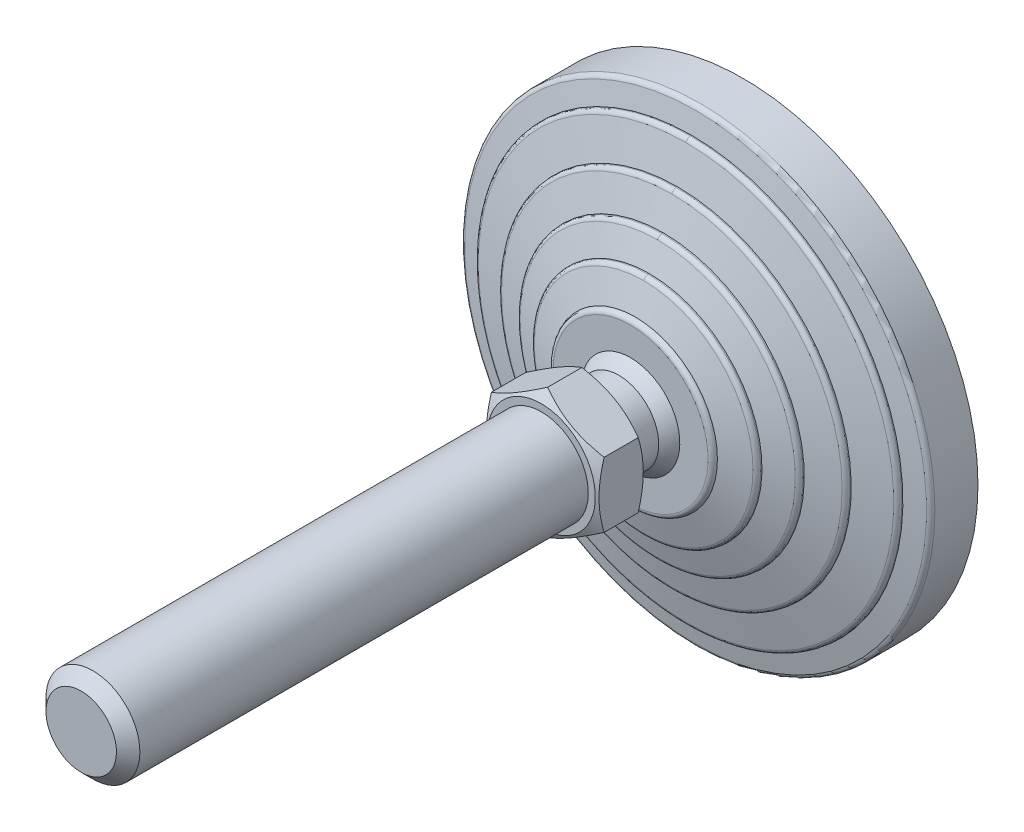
ISO-10303-21;
HEADER;
FILE_DESCRIPTION(('STEP AP214'),'2;1');
FILE_NAME('part.step','',(''),(''),'','','');
FILE_SCHEMA(('AUTOMOTIVE_DESIGN { 1 0 10303 214 1 1 1 1 }'));
ENDSEC;
DATA;
#1=APPLICATION_CONTEXT('core data for automotive mechanical design processes');
#2=APPLICATION_PROTOCOL_DEFINITION('international standard','automotive_design',2000,#1);
#3=PRODUCT_CONTEXT('',#1,'mechanical');
#4=PRODUCT('Part','Part','',(#3));
#5=PRODUCT_RELATED_PRODUCT_CATEGORY('part','',(#4));
#6=PRODUCT_DEFINITION_FORMATION('','',#4);
#7=PRODUCT_DEFINITION_CONTEXT('part definition',#1,'design');
#8=PRODUCT_DEFINITION('design','',#6,#7);
#9=PRODUCT_DEFINITION_SHAPE('','',#8);
#10=(LENGTH_UNIT() NAMED_UNIT(*) SI_UNIT(.MILLI.,.METRE.));
#11=(NAMED_UNIT(*) PLANE_ANGLE_UNIT() SI_UNIT($,.RADIAN.));
#12=(NAMED_UNIT(*) SI_UNIT($,.STERADIAN.) SOLID_ANGLE_UNIT());
#13=UNCERTAINTY_MEASURE_WITH_UNIT(LENGTH_MEASURE(1.E-05),#10,'distance_accuracy_value','');
#14=(GEOMETRIC_REPRESENTATION_CONTEXT(3) GLOBAL_UNCERTAINTY_ASSIGNED_CONTEXT((#13)) GLOBAL_UNIT_ASSIGNED_CONTEXT((#10,
#11,#12)) REPRESENTATION_CONTEXT('',''));
#15=CARTESIAN_POINT('',(0.,0.,0.));
#16=DIRECTION('',(0.,0.,1.));
#17=DIRECTION('',(1.,0.,0.));
#18=AXIS2_PLACEMENT_3D('',#15,#16,#17);
#19=CARTESIAN_POINT('',(-50.774113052,50.6,0.));
#20=DIRECTION('',(0.,0.,1.));
#21=DIRECTION('',(0.,-1.,0.));
#22=AXIS2_PLACEMENT_3D('',#19,#20,#21);
#23=PLANE('',#22);
#24=CARTESIAN_POINT('',(0.,0.,0.));
#25=DIRECTION('',(0.,0.,-1.));
#26=DIRECTION('',(1.,0.,0.));
#27=AXIS2_PLACEMENT_3D('',#24,#25,#26);
#28=CIRCLE('',#27,50.);
#29=CARTESIAN_POINT('',(50.,0.,0.));
#30=VERTEX_POINT('',#29);
#31=EDGE_CURVE('E167',#30,#30,#28,.F.);
#32=ORIENTED_EDGE('',*,*,#31,.F.);
#33=EDGE_LOOP('',(#32));
#34=FACE_BOUND('',#33,.T.);
#35=ADVANCED_FACE('F14',(#34),#23,.F.);
#36=CARTESIAN_POINT('',(0.,0.,9.180196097));
#37=DIRECTION('',(0.,0.,-1.));
#38=DIRECTION('',(1.,0.,0.));
#39=AXIS2_PLACEMENT_3D('',#36,#37,#38);
#40=CYLINDRICAL_SURFACE('',#39,50.);
#41=ORIENTED_EDGE('',*,*,#31,.T.);
#42=EDGE_LOOP('',(#41));
#43=FACE_BOUND('',#42,.T.);
#44=CARTESIAN_POINT('',(0.,0.,9.180196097));
#45=DIRECTION('',(0.,0.,1.));
#46=DIRECTION('',(0.,-1.,0.));
#47=AXIS2_PLACEMENT_3D('',#44,#45,#46);
#48=CIRCLE('',#47,50.);
#49=CARTESIAN_POINT('',(0.,-50.,9.180196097));
#50=VERTEX_POINT('',#49);
#51=EDGE_CURVE('E169',#50,#50,#48,.T.);
#52=ORIENTED_EDGE('',*,*,#51,.F.);
#53=EDGE_LOOP('',(#52));
#54=FACE_BOUND('',#53,.T.);
#55=ADVANCED_FACE('F318',(#43,#54),#40,.T.);
#56=CARTESIAN_POINT('',(0.,0.,9.18019609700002));
#57=DIRECTION('',(0.,0.,-1.));
#58=DIRECTION('',(0.,1.,0.));
#59=AXIS2_PLACEMENT_3D('',#56,#57,#58);
#60=TOROIDAL_SURFACE('',#59,48.9999999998,1.00000000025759);
#61=ORIENTED_EDGE('',*,*,#51,.T.);
#62=EDGE_LOOP('',(#61));
#63=FACE_BOUND('',#62,.T.);
#64=CARTESIAN_POINT('',(0.,0.,10.1607767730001));
#65=DIRECTION('',(0.,0.,-1.));
#66=DIRECTION('',(0.,1.,0.));
#67=AXIS2_PLACEMENT_3D('',#64,#65,#66);
#68=CIRCLE('',#67,49.196116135);
#69=CARTESIAN_POINT('',(0.,49.196116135,10.160776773));
#70=VERTEX_POINT('',#69);
#71=EDGE_CURVE('E173',#70,#70,#68,.F.);
#72=ORIENTED_EDGE('',*,*,#71,.F.);
#73=EDGE_LOOP('',(#72));
#74=FACE_BOUND('',#73,.T.);
#75=ADVANCED_FACE('F314',(#63,#74),#60,.T.);
#76=CARTESIAN_POINT('',(0.,0.,11.));
#77=DIRECTION('',(0.,0.,-1.));
#78=DIRECTION('',(0.,1.,0.));
#79=AXIS2_PLACEMENT_3D('',#76,#77,#78);
#80=CONICAL_SURFACE('',#79,45.,1.37340076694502);
#81=ORIENTED_EDGE('',*,*,#71,.T.);
#82=EDGE_LOOP('',(#81));
#83=FACE_BOUND('',#82,.T.);
#84=CARTESIAN_POINT('',(0.,0.,11.));
#85=DIRECTION('',(0.,0.,-1.));
#86=DIRECTION('',(0.,1.,0.));
#87=AXIS2_PLACEMENT_3D('',#84,#85,#86);
#88=CIRCLE('',#87,45.);
#89=CARTESIAN_POINT('',(0.,45.,11.));
#90=VERTEX_POINT('',#89);
#91=EDGE_CURVE('E464',#90,#90,#88,.F.);
#92=ORIENTED_EDGE('',*,*,#91,.F.);
#93=EDGE_LOOP('',(#92));
#94=FACE_BOUND('',#93,.T.);
#95=ADVANCED_FACE('F317',(#83,#94),#80,.T.);
#96=CARTESIAN_POINT('',(0.,0.,11.219223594));
#97=DIRECTION('',(0.,0.,-1.));
#98=DIRECTION('',(0.,1.,0.));
#99=AXIS2_PLACEMENT_3D('',#96,#97,#98);
#100=CYLINDRICAL_SURFACE('',#99,45.);
#101=ORIENTED_EDGE('',*,*,#91,.T.);
#102=EDGE_LOOP('',(#101));
#103=FACE_BOUND('',#102,.T.);
#104=CARTESIAN_POINT('',(0.,0.,11.219223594));
#105=DIRECTION('',(0.,0.,1.));
#106=DIRECTION('',(0.,-1.,0.));
#107=AXIS2_PLACEMENT_3D('',#104,#105,#106);
#108=CIRCLE('',#107,45.);
#109=CARTESIAN_POINT('',(-4.61482714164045E-09,-45.,11.219223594));
#110=VERTEX_POINT('',#109);
#111=CARTESIAN_POINT('',(0.,45.,11.219223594));
#112=VERTEX_POINT('',#111);
#113=EDGE_CURVE('E637',#110,#112,#108,.T.);
#114=ORIENTED_EDGE('',*,*,#113,.F.);
#115=CARTESIAN_POINT('',(0.,0.,11.219223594));
#116=DIRECTION('',(0.,0.,1.));
#117=DIRECTION('',(0.,-1.,0.));
#118=AXIS2_PLACEMENT_3D('',#115,#116,#117);
#119=CIRCLE('',#118,45.);
#120=EDGE_CURVE('E467',#112,#110,#119,.T.);
#121=ORIENTED_EDGE('',*,*,#120,.F.);
#122=EDGE_LOOP('',(#114,#121));
#123=FACE_BOUND('',#122,.T.);
#124=ADVANCED_FACE('F443',(#103,#123),#100,.T.);
#125=CARTESIAN_POINT('',(0.,-45.,11.219223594));
#126=CARTESIAN_POINT('',(-90.0000000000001,-45.,11.219223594));
#127=CARTESIAN_POINT('',(-90.0000000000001,45.,11.219223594));
#128=CARTESIAN_POINT('',(0.,45.,11.219223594));
#129=CARTESIAN_POINT('',(0.,-45.,11.696951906));
#130=CARTESIAN_POINT('',(-90.0000000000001,-45.,11.696951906));
#131=CARTESIAN_POINT('',(-90.0000000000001,45.,11.696951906));
#132=CARTESIAN_POINT('',(0.,45.,11.696951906));
#133=CARTESIAN_POINT('',(0.,-44.706000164,12.073499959));
#134=CARTESIAN_POINT('',(-89.412000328,-44.706000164,12.073499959));
#135=CARTESIAN_POINT('',(-89.412000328,44.706000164,12.073499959));
#136=CARTESIAN_POINT('',(0.,44.706000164,12.073499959));
#137=CARTESIAN_POINT('',(0.,-44.242535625,12.189366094));
#138=CARTESIAN_POINT('',(-88.4850712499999,-44.2425356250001,12.189366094));
#139=CARTESIAN_POINT('',(-88.4850712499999,44.2425356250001,12.189366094));
#140=CARTESIAN_POINT('',(0.,44.242535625,12.189366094));
#141=(BOUNDED_SURFACE() B_SPLINE_SURFACE(3,3,((#125,#126,#127,#128),(#129,#130,#131,#132),(#133,
#134,#135,#136),(#137,#138,#139,#140)),.UNSPECIFIED.,.F.,.F.,
.F.) B_SPLINE_SURFACE_WITH_KNOTS((4,4),(4,4),(0.,1.),(0.,1.),
.UNSPECIFIED.) GEOMETRIC_REPRESENTATION_ITEM() RATIONAL_B_SPLINE_SURFACE(((1.,0.333333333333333,
0.333333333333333,1.),(0.858803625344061,0.286267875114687,0.286267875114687,0.858803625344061),
(0.858803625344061,0.286267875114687,0.286267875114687,0.858803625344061),(1.,0.333333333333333,
0.333333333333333,1.))) REPRESENTATION_ITEM('') SURFACE());
#142=CARTESIAN_POINT('',(0.,45.,11.219223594));
#143=CARTESIAN_POINT('',(0.,45.,11.696951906));
#144=CARTESIAN_POINT('',(0.,44.706000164,12.073499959));
#145=CARTESIAN_POINT('',(0.,44.242535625,12.189366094));
#146=(BOUNDED_CURVE() B_SPLINE_CURVE(3,(#142,#143,#144,#145),.UNSPECIFIED.,.F.,
.F.) B_SPLINE_CURVE_WITH_KNOTS((4,4),(0.,1.),
.UNSPECIFIED.) CURVE() GEOMETRIC_REPRESENTATION_ITEM() RATIONAL_B_SPLINE_CURVE((1.,
0.858803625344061,0.858803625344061,1.)) REPRESENTATION_ITEM(''));
#147=CARTESIAN_POINT('',(0.,44.242535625,12.189366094));
#148=VERTEX_POINT('',#147);
#149=EDGE_CURVE('E628',#112,#148,#146,.T.);
#150=CARTESIAN_POINT('',(0.,-45.,11.219223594));
#151=CARTESIAN_POINT('',(0.,-45.,11.696951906));
#152=CARTESIAN_POINT('',(0.,-44.706000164,12.073499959));
#153=CARTESIAN_POINT('',(0.,-44.242535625,12.189366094));
#154=(BOUNDED_CURVE() B_SPLINE_CURVE(3,(#150,#151,#152,#153),.UNSPECIFIED.,.F.,
.F.) B_SPLINE_CURVE_WITH_KNOTS((4,4),(0.,1.),
.UNSPECIFIED.) CURVE() GEOMETRIC_REPRESENTATION_ITEM() RATIONAL_B_SPLINE_CURVE((1.,
0.858803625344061,0.858803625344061,1.)) REPRESENTATION_ITEM(''));
#155=CARTESIAN_POINT('',(-1.3611443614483E-08,-44.242535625,12.189366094));
#156=VERTEX_POINT('',#155);
#157=EDGE_CURVE('E642',#156,#110,#154,.F.);
#158=CARTESIAN_POINT('',(0.,0.,12.189366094));
#159=DIRECTION('',(0.,0.,-1.));
#160=DIRECTION('',(0.,1.,0.));
#161=AXIS2_PLACEMENT_3D('',#158,#159,#160);
#162=CIRCLE('',#161,44.242535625);
#163=EDGE_CURVE('E625',#148,#156,#162,.F.);
#164=ORIENTED_EDGE('',*,*,#149,.F.);
#165=ORIENTED_EDGE('',*,*,#120,.T.);
#166=ORIENTED_EDGE('',*,*,#157,.F.);
#167=ORIENTED_EDGE('',*,*,#163,.F.);
#168=EDGE_LOOP('',(#164,#165,#166,#167));
#169=FACE_BOUND('',#168,.T.);
#170=ADVANCED_FACE('F432',(#169),#141,.T.);
#171=CARTESIAN_POINT('',(0.,45.,11.219223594));
#172=CARTESIAN_POINT('',(90.0000000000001,45.,11.219223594));
#173=CARTESIAN_POINT('',(90.0000000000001,-45.,11.219223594));
#174=CARTESIAN_POINT('',(0.,-45.,11.219223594));
#175=CARTESIAN_POINT('',(0.,45.,11.696951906));
#176=CARTESIAN_POINT('',(90.0000000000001,45.,11.696951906));
#177=CARTESIAN_POINT('',(90.0000000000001,-45.,11.696951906));
#178=CARTESIAN_POINT('',(0.,-45.,11.696951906));
#179=CARTESIAN_POINT('',(0.,44.706000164,12.073499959));
#180=CARTESIAN_POINT('',(89.412000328,44.706000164,12.073499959));
#181=CARTESIAN_POINT('',(89.412000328,-44.706000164,12.073499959));
#182=CARTESIAN_POINT('',(0.,-44.706000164,12.073499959));
#183=CARTESIAN_POINT('',(0.,44.242535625,12.189366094));
#184=CARTESIAN_POINT('',(88.4850712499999,44.2425356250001,12.189366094));
#185=CARTESIAN_POINT('',(88.4850712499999,-44.2425356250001,12.189366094));
#186=CARTESIAN_POINT('',(0.,-44.242535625,12.189366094));
#187=(BOUNDED_SURFACE() B_SPLINE_SURFACE(3,3,((#171,#172,#173,#174),(#175,#176,#177,#178),(#179,
#180,#181,#182),(#183,#184,#185,#186)),.UNSPECIFIED.,.F.,.F.,
.F.) B_SPLINE_SURFACE_WITH_KNOTS((4,4),(4,4),(0.,1.),(0.,1.),
.UNSPECIFIED.) GEOMETRIC_REPRESENTATION_ITEM() RATIONAL_B_SPLINE_SURFACE(((1.,0.333333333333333,
0.333333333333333,1.),(0.858803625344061,0.286267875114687,0.286267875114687,0.858803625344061),
(0.858803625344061,0.286267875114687,0.286267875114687,0.858803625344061),(1.,0.333333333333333,
0.333333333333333,1.))) REPRESENTATION_ITEM('') SURFACE());
#188=CARTESIAN_POINT('',(0.,0.,12.189366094));
#189=DIRECTION('',(0.,0.,-1.));
#190=DIRECTION('',(0.,1.,0.));
#191=AXIS2_PLACEMENT_3D('',#188,#189,#190);
#192=CIRCLE('',#191,44.242535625);
#193=EDGE_CURVE('E624',#156,#148,#192,.F.);
#194=ORIENTED_EDGE('',*,*,#113,.T.);
#195=ORIENTED_EDGE('',*,*,#149,.T.);
#196=ORIENTED_EDGE('',*,*,#193,.F.);
#197=ORIENTED_EDGE('',*,*,#157,.T.);
#198=EDGE_LOOP('',(#194,#195,#196,#197));
#199=FACE_BOUND('',#198,.T.);
#200=ADVANCED_FACE('F426',(#199),#187,.T.);
#201=CARTESIAN_POINT('',(0.,0.,14.));
#202=DIRECTION('',(0.,0.,-1.));
#203=DIRECTION('',(1.,0.,0.));
#204=AXIS2_PLACEMENT_3D('',#201,#202,#203);
#205=CONICAL_SURFACE('',#204,37.,1.32581766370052);
#206=ORIENTED_EDGE('',*,*,#163,.T.);
#207=ORIENTED_EDGE('',*,*,#193,.T.);
#208=EDGE_LOOP('',(#206,#207));
#209=FACE_BOUND('',#208,.T.);
#210=CARTESIAN_POINT('',(0.,0.,14.));
#211=DIRECTION('',(0.,0.,-1.));
#212=DIRECTION('',(0.,1.,0.));
#213=AXIS2_PLACEMENT_3D('',#210,#211,#212);
#214=CIRCLE('',#213,37.);
#215=CARTESIAN_POINT('',(0.,37.,14.));
#216=VERTEX_POINT('',#215);
#217=EDGE_CURVE('E615',#216,#216,#214,.F.);
#218=ORIENTED_EDGE('',*,*,#217,.F.);
#219=EDGE_LOOP('',(#218));
#220=FACE_BOUND('',#219,.T.);
#221=ADVANCED_FACE('F422',(#209,#220),#205,.T.);
#222=CARTESIAN_POINT('',(0.,0.,14.245698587));
#223=DIRECTION('',(0.,0.,-1.));
#224=DIRECTION('',(1.,0.,0.));
#225=AXIS2_PLACEMENT_3D('',#222,#223,#224);
#226=CYLINDRICAL_SURFACE('',#225,37.);
#227=ORIENTED_EDGE('',*,*,#217,.T.);
#228=EDGE_LOOP('',(#227));
#229=FACE_BOUND('',#228,.T.);
#230=CARTESIAN_POINT('',(0.,0.,14.245698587));
#231=DIRECTION('',(0.,0.,1.));
#232=DIRECTION('',(0.,-1.,0.));
#233=AXIS2_PLACEMENT_3D('',#230,#231,#232);
#234=CIRCLE('',#233,37.);
#235=CARTESIAN_POINT('',(-3.79441342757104E-09,-37.,14.245698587));
#236=VERTEX_POINT('',#235);
#237=CARTESIAN_POINT('',(0.,37.,14.245698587));
#238=VERTEX_POINT('',#237);
#239=EDGE_CURVE('E595',#236,#238,#234,.T.);
#240=ORIENTED_EDGE('',*,*,#239,.F.);
#241=CARTESIAN_POINT('',(0.,0.,14.245698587));
#242=DIRECTION('',(0.,0.,1.));
#243=DIRECTION('',(0.,-1.,0.));
#244=AXIS2_PLACEMENT_3D('',#241,#242,#243);
#245=CIRCLE('',#244,37.);
#246=EDGE_CURVE('E606',#238,#236,#245,.T.);
#247=ORIENTED_EDGE('',*,*,#246,.F.);
#248=EDGE_LOOP('',(#240,#247));
#249=FACE_BOUND('',#248,.T.);
#250=ADVANCED_FACE('F413',(#229,#249),#226,.T.);
#251=CARTESIAN_POINT('',(0.,-37.,14.245698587));
#252=CARTESIAN_POINT('',(-74.,-37.,14.245698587));
#253=CARTESIAN_POINT('',(-74.,37.,14.245698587));
#254=CARTESIAN_POINT('',(0.,37.,14.245698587));
#255=CARTESIAN_POINT('',(0.,-37.,14.709515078));
#256=CARTESIAN_POINT('',(-74.,-37.,14.709515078));
#257=CARTESIAN_POINT('',(-74.,37.,14.709515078));
#258=CARTESIAN_POINT('',(0.,37.,14.709515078));
#259=CARTESIAN_POINT('',(0.,-36.720691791,15.079802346));
#260=CARTESIAN_POINT('',(-73.441383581,-36.720691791,15.079802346));
#261=CARTESIAN_POINT('',(-73.441383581,36.720691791,15.079802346));
#262=CARTESIAN_POINT('',(0.,36.720691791,15.079802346));
#263=CARTESIAN_POINT('',(0.,-36.274721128,15.207222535));
#264=CARTESIAN_POINT('',(-72.549442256,-36.274721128,15.207222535));
#265=CARTESIAN_POINT('',(-72.549442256,36.274721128,15.207222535));
#266=CARTESIAN_POINT('',(0.,36.274721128,15.207222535));
#267=(BOUNDED_SURFACE() B_SPLINE_SURFACE(3,3,((#251,#252,#253,#254),(#255,#256,#257,#258),(#259,
#260,#261,#262),(#263,#264,#265,#266)),.UNSPECIFIED.,.F.,.F.,
.F.) B_SPLINE_SURFACE_WITH_KNOTS((4,4),(4,4),(0.,1.),(0.,1.),
.UNSPECIFIED.) GEOMETRIC_REPRESENTATION_ITEM() RATIONAL_B_SPLINE_SURFACE(((1.,0.333333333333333,
0.333333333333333,1.),(0.865565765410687,0.288521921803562,0.288521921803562,0.865565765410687),
(0.865565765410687,0.288521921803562,0.288521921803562,0.865565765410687),(1.,0.333333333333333,
0.333333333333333,1.))) REPRESENTATION_ITEM('') SURFACE());
#268=CARTESIAN_POINT('',(0.,37.,14.245698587));
#269=CARTESIAN_POINT('',(0.,37.,14.709515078));
#270=CARTESIAN_POINT('',(0.,36.720691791,15.079802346));
#271=CARTESIAN_POINT('',(0.,36.274721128,15.207222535));
#272=(BOUNDED_CURVE() B_SPLINE_CURVE(3,(#268,#269,#270,#271),.UNSPECIFIED.,.F.,
.F.) B_SPLINE_CURVE_WITH_KNOTS((4,4),(0.,1.),
.UNSPECIFIED.) CURVE() GEOMETRIC_REPRESENTATION_ITEM() RATIONAL_B_SPLINE_CURVE((1.,
0.865565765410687,0.865565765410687,1.)) REPRESENTATION_ITEM(''));
#273=CARTESIAN_POINT('',(0.,36.274721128,15.2072225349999));
#274=VERTEX_POINT('',#273);
#275=EDGE_CURVE('E586',#238,#274,#272,.T.);
#276=CARTESIAN_POINT('',(0.,-37.,14.245698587));
#277=CARTESIAN_POINT('',(0.,-37.,14.709515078));
#278=CARTESIAN_POINT('',(0.,-36.720691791,15.079802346));
#279=CARTESIAN_POINT('',(0.,-36.274721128,15.207222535));
#280=(BOUNDED_CURVE() B_SPLINE_CURVE(3,(#276,#277,#278,#279),.UNSPECIFIED.,.F.,
.F.) B_SPLINE_CURVE_WITH_KNOTS((4,4),(0.,1.),
.UNSPECIFIED.) CURVE() GEOMETRIC_REPRESENTATION_ITEM() RATIONAL_B_SPLINE_CURVE((1.,
0.865565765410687,0.865565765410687,1.)) REPRESENTATION_ITEM(''));
#281=CARTESIAN_POINT('',(-1.11601045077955E-08,-36.274721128,15.2072225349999));
#282=VERTEX_POINT('',#281);
#283=EDGE_CURVE('E600',#282,#236,#280,.F.);
#284=CARTESIAN_POINT('',(0.,0.,15.2072225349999));
#285=DIRECTION('',(0.,0.,-1.));
#286=DIRECTION('',(0.,1.,0.));
#287=AXIS2_PLACEMENT_3D('',#284,#285,#286);
#288=CIRCLE('',#287,36.274721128);
#289=EDGE_CURVE('E583',#274,#282,#288,.F.);
#290=ORIENTED_EDGE('',*,*,#275,.F.);
#291=ORIENTED_EDGE('',*,*,#246,.T.);
#292=ORIENTED_EDGE('',*,*,#283,.F.);
#293=ORIENTED_EDGE('',*,*,#289,.F.);
#294=EDGE_LOOP('',(#290,#291,#292,#293));
#295=FACE_BOUND('',#294,.T.);
#296=ADVANCED_FACE('F402',(#295),#267,.T.);
#297=CARTESIAN_POINT('',(0.,37.,14.245698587));
#298=CARTESIAN_POINT('',(74.,37.,14.245698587));
#299=CARTESIAN_POINT('',(74.,-37.,14.245698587));
#300=CARTESIAN_POINT('',(0.,-37.,14.245698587));
#301=CARTESIAN_POINT('',(0.,37.,14.709515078));
#302=CARTESIAN_POINT('',(74.,37.,14.709515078));
#303=CARTESIAN_POINT('',(74.,-37.,14.709515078));
#304=CARTESIAN_POINT('',(0.,-37.,14.709515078));
#305=CARTESIAN_POINT('',(0.,36.720691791,15.079802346));
#306=CARTESIAN_POINT('',(73.441383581,36.720691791,15.079802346));
#307=CARTESIAN_POINT('',(73.441383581,-36.720691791,15.079802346));
#308=CARTESIAN_POINT('',(0.,-36.720691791,15.079802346));
#309=CARTESIAN_POINT('',(0.,36.274721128,15.207222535));
#310=CARTESIAN_POINT('',(72.549442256,36.274721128,15.207222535));
#311=CARTESIAN_POINT('',(72.549442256,-36.274721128,15.207222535));
#312=CARTESIAN_POINT('',(0.,-36.274721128,15.207222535));
#313=(BOUNDED_SURFACE() B_SPLINE_SURFACE(3,3,((#297,#298,#299,#300),(#301,#302,#303,#304),(#305,
#306,#307,#308),(#309,#310,#311,#312)),.UNSPECIFIED.,.F.,.F.,
.F.) B_SPLINE_SURFACE_WITH_KNOTS((4,4),(4,4),(0.,1.),(0.,1.),
.UNSPECIFIED.) GEOMETRIC_REPRESENTATION_ITEM() RATIONAL_B_SPLINE_SURFACE(((1.,0.333333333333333,
0.333333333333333,1.),(0.865565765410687,0.288521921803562,0.288521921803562,0.865565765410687),
(0.865565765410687,0.288521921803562,0.288521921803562,0.865565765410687),(1.,0.333333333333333,
0.333333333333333,1.))) REPRESENTATION_ITEM('') SURFACE());
#314=CARTESIAN_POINT('',(0.,0.,15.2072225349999));
#315=DIRECTION('',(0.,0.,-1.));
#316=DIRECTION('',(0.,1.,0.));
#317=AXIS2_PLACEMENT_3D('',#314,#315,#316);
#318=CIRCLE('',#317,36.274721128);
#319=EDGE_CURVE('E582',#282,#274,#318,.F.);
#320=ORIENTED_EDGE('',*,*,#239,.T.);
#321=ORIENTED_EDGE('',*,*,#275,.T.);
#322=ORIENTED_EDGE('',*,*,#319,.F.);
#323=ORIENTED_EDGE('',*,*,#283,.T.);
#324=EDGE_LOOP('',(#320,#321,#322,#323));
#325=FACE_BOUND('',#324,.T.);
#326=ADVANCED_FACE('F396',(#325),#313,.T.);
#327=CARTESIAN_POINT('',(0.,0.,17.));
#328=DIRECTION('',(0.,0.,-1.));
#329=DIRECTION('',(0.,1.,0.));
#330=AXIS2_PLACEMENT_3D('',#327,#328,#329);
#331=CONICAL_SURFACE('',#330,30.,1.29249666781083);
#332=ORIENTED_EDGE('',*,*,#289,.T.);
#333=ORIENTED_EDGE('',*,*,#319,.T.);
#334=EDGE_LOOP('',(#332,#333));
#335=FACE_BOUND('',#334,.T.);
#336=CARTESIAN_POINT('',(0.,0.,17.));
#337=DIRECTION('',(0.,0.,-1.));
#338=DIRECTION('',(0.,1.,0.));
#339=AXIS2_PLACEMENT_3D('',#336,#337,#338);
#340=CIRCLE('',#339,30.);
#341=CARTESIAN_POINT('',(0.,30.,17.));
#342=VERTEX_POINT('',#341);
#343=EDGE_CURVE('E573',#342,#342,#340,.F.);
#344=ORIENTED_EDGE('',*,*,#343,.F.);
#345=EDGE_LOOP('',(#344));
#346=FACE_BOUND('',#345,.T.);
#347=ADVANCED_FACE('F392',(#335,#346),#331,.T.);
#348=CARTESIAN_POINT('',(0.,0.,17.27924078));
#349=DIRECTION('',(0.,0.,-1.));
#350=DIRECTION('',(0.,1.,0.));
#351=AXIS2_PLACEMENT_3D('',#348,#349,#350);
#352=CYLINDRICAL_SURFACE('',#351,30.);
#353=ORIENTED_EDGE('',*,*,#343,.T.);
#354=EDGE_LOOP('',(#353));
#355=FACE_BOUND('',#354,.T.);
#356=CARTESIAN_POINT('',(0.,0.,17.27924078));
#357=DIRECTION('',(0.,0.,1.));
#358=DIRECTION('',(0.,-1.,0.));
#359=AXIS2_PLACEMENT_3D('',#356,#357,#358);
#360=CIRCLE('',#359,30.);
#361=CARTESIAN_POINT('',(-3.0765514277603E-09,-30.,17.27924078));
#362=VERTEX_POINT('',#361);
#363=CARTESIAN_POINT('',(0.,30.,17.27924078));
#364=VERTEX_POINT('',#363);
#365=EDGE_CURVE('E553',#362,#364,#360,.T.);
#366=ORIENTED_EDGE('',*,*,#365,.F.);
#367=CARTESIAN_POINT('',(0.,0.,17.27924078));
#368=DIRECTION('',(0.,0.,1.));
#369=DIRECTION('',(0.,-1.,0.));
#370=AXIS2_PLACEMENT_3D('',#367,#368,#369);
#371=CIRCLE('',#370,30.);
#372=EDGE_CURVE('E564',#364,#362,#371,.T.);
#373=ORIENTED_EDGE('',*,*,#372,.F.);
#374=EDGE_LOOP('',(#366,#373));
#375=FACE_BOUND('',#374,.T.);
#376=ADVANCED_FACE('F383',(#355,#375),#352,.T.);
#377=CARTESIAN_POINT('',(0.,-30.,17.27924078));
#378=CARTESIAN_POINT('',(-60.0000000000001,-30.,17.27924078));
#379=CARTESIAN_POINT('',(-60.0000000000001,30.,17.27924078));
#380=CARTESIAN_POINT('',(0.,30.,17.27924078));
#381=CARTESIAN_POINT('',(0.,-30.,17.725161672));
#382=CARTESIAN_POINT('',(-60.,-30.,17.725161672));
#383=CARTESIAN_POINT('',(-60.,30.,17.725161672));
#384=CARTESIAN_POINT('',(0.,30.,17.725161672));
#385=CARTESIAN_POINT('',(0.,-29.739265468,18.086911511));
#386=CARTESIAN_POINT('',(-59.478530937,-29.739265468,18.086911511));
#387=CARTESIAN_POINT('',(-59.478530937,29.739265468,18.086911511));
#388=CARTESIAN_POINT('',(0.,29.739265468,18.086911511));
#389=CARTESIAN_POINT('',(0.,-29.316227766,18.227924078));
#390=CARTESIAN_POINT('',(-58.6324555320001,-29.316227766,18.227924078));
#391=CARTESIAN_POINT('',(-58.6324555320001,29.316227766,18.227924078));
#392=CARTESIAN_POINT('',(0.,29.316227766,18.227924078));
#393=(BOUNDED_SURFACE() B_SPLINE_SURFACE(3,3,((#377,#378,#379,#380),(#381,#382,#383,#384),(#385,
#386,#387,#388),(#389,#390,#391,#392)),.UNSPECIFIED.,.F.,.F.,
.F.) B_SPLINE_SURFACE_WITH_KNOTS((4,4),(4,4),(0.,1.),(0.,1.),
.UNSPECIFIED.) GEOMETRIC_REPRESENTATION_ITEM() RATIONAL_B_SPLINE_SURFACE(((1.,0.333333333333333,
0.333333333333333,1.),(0.87416145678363,0.29138715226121,0.29138715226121,0.87416145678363),
(0.87416145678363,0.29138715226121,0.29138715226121,0.87416145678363),(1.,0.333333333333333,
0.333333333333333,1.))) REPRESENTATION_ITEM('') SURFACE());
#394=CARTESIAN_POINT('',(0.,30.,17.27924078));
#395=CARTESIAN_POINT('',(0.,30.,17.725161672));
#396=CARTESIAN_POINT('',(0.,29.739265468,18.086911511));
#397=CARTESIAN_POINT('',(0.,29.316227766,18.227924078));
#398=(BOUNDED_CURVE() B_SPLINE_CURVE(3,(#394,#395,#396,#397),.UNSPECIFIED.,.F.,
.F.) B_SPLINE_CURVE_WITH_KNOTS((4,4),(0.,1.),
.UNSPECIFIED.) CURVE() GEOMETRIC_REPRESENTATION_ITEM() RATIONAL_B_SPLINE_CURVE((1.,
0.87416145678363,0.87416145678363,1.)) REPRESENTATION_ITEM(''));
#399=CARTESIAN_POINT('',(0.,29.3162277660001,18.2279240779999));
#400=VERTEX_POINT('',#399);
#401=EDGE_CURVE('E544',#364,#400,#398,.T.);
#402=CARTESIAN_POINT('',(0.,-30.,17.27924078));
#403=CARTESIAN_POINT('',(0.,-30.,17.725161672));
#404=CARTESIAN_POINT('',(0.,-29.739265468,18.086911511));
#405=CARTESIAN_POINT('',(0.,-29.316227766,18.227924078));
#406=(BOUNDED_CURVE() B_SPLINE_CURVE(3,(#402,#403,#404,#405),.UNSPECIFIED.,.F.,
.F.) B_SPLINE_CURVE_WITH_KNOTS((4,4),(0.,1.),
.UNSPECIFIED.) CURVE() GEOMETRIC_REPRESENTATION_ITEM() RATIONAL_B_SPLINE_CURVE((1.,
0.87416145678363,0.87416145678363,1.)) REPRESENTATION_ITEM(''));
#407=CARTESIAN_POINT('',(-9.01928823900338E-09,-29.3162277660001,18.2279240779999));
#408=VERTEX_POINT('',#407);
#409=EDGE_CURVE('E558',#408,#362,#406,.F.);
#410=CARTESIAN_POINT('',(0.,0.,18.2279240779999));
#411=DIRECTION('',(0.,0.,-1.));
#412=DIRECTION('',(0.,1.,0.));
#413=AXIS2_PLACEMENT_3D('',#410,#411,#412);
#414=CIRCLE('',#413,29.316227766);
#415=EDGE_CURVE('E541',#400,#408,#414,.F.);
#416=ORIENTED_EDGE('',*,*,#401,.F.);
#417=ORIENTED_EDGE('',*,*,#372,.T.);
#418=ORIENTED_EDGE('',*,*,#409,.F.);
#419=ORIENTED_EDGE('',*,*,#415,.F.);
#420=EDGE_LOOP('',(#416,#417,#418,#419));
#421=FACE_BOUND('',#420,.T.);
#422=ADVANCED_FACE('F372',(#421),#393,.T.);
#423=CARTESIAN_POINT('',(0.,30.,17.27924078));
#424=CARTESIAN_POINT('',(60.0000000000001,30.,17.27924078));
#425=CARTESIAN_POINT('',(60.0000000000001,-30.,17.27924078));
#426=CARTESIAN_POINT('',(0.,-30.,17.27924078));
#427=CARTESIAN_POINT('',(0.,30.,17.725161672));
#428=CARTESIAN_POINT('',(60.,30.,17.725161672));
#429=CARTESIAN_POINT('',(60.,-30.,17.725161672));
#430=CARTESIAN_POINT('',(0.,-30.,17.725161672));
#431=CARTESIAN_POINT('',(0.,29.739265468,18.086911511));
#432=CARTESIAN_POINT('',(59.478530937,29.739265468,18.086911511));
#433=CARTESIAN_POINT('',(59.478530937,-29.739265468,18.086911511));
#434=CARTESIAN_POINT('',(0.,-29.739265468,18.086911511));
#435=CARTESIAN_POINT('',(0.,29.316227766,18.227924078));
#436=CARTESIAN_POINT('',(58.6324555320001,29.316227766,18.227924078));
#437=CARTESIAN_POINT('',(58.6324555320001,-29.316227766,18.227924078));
#438=CARTESIAN_POINT('',(0.,-29.316227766,18.227924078));
#439=(BOUNDED_SURFACE() B_SPLINE_SURFACE(3,3,((#423,#424,#425,#426),(#427,#428,#429,#430),(#431,
#432,#433,#434),(#435,#436,#437,#438)),.UNSPECIFIED.,.F.,.F.,
.F.) B_SPLINE_SURFACE_WITH_KNOTS((4,4),(4,4),(0.,1.),(0.,1.),
.UNSPECIFIED.) GEOMETRIC_REPRESENTATION_ITEM() RATIONAL_B_SPLINE_SURFACE(((1.,0.333333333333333,
0.333333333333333,1.),(0.87416145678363,0.29138715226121,0.29138715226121,0.87416145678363),
(0.87416145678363,0.29138715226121,0.29138715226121,0.87416145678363),(1.,0.333333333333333,
0.333333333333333,1.))) REPRESENTATION_ITEM('') SURFACE());
#440=CARTESIAN_POINT('',(0.,0.,18.2279240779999));
#441=DIRECTION('',(0.,0.,-1.));
#442=DIRECTION('',(0.,1.,0.));
#443=AXIS2_PLACEMENT_3D('',#440,#441,#442);
#444=CIRCLE('',#443,29.316227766);
#445=EDGE_CURVE('E540',#408,#400,#444,.F.);
#446=ORIENTED_EDGE('',*,*,#365,.T.);
#447=ORIENTED_EDGE('',*,*,#401,.T.);
#448=ORIENTED_EDGE('',*,*,#445,.F.);
#449=ORIENTED_EDGE('',*,*,#409,.T.);
#450=EDGE_LOOP('',(#446,#447,#448,#449));
#451=FACE_BOUND('',#450,.T.);
#452=ADVANCED_FACE('F366',(#451),#439,.T.);
#453=CARTESIAN_POINT('',(0.,0.,20.));
#454=DIRECTION('',(0.,0.,-1.));
#455=DIRECTION('',(1.,0.,0.));
#456=AXIS2_PLACEMENT_3D('',#453,#454,#455);
#457=CONICAL_SURFACE('',#456,24.,1.24904577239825);
#458=ORIENTED_EDGE('',*,*,#415,.T.);
#459=ORIENTED_EDGE('',*,*,#445,.T.);
#460=EDGE_LOOP('',(#458,#459));
#461=FACE_BOUND('',#460,.T.);
#462=CARTESIAN_POINT('',(0.,0.,20.));
#463=DIRECTION('',(0.,0.,-1.));
#464=DIRECTION('',(0.,1.,0.));
#465=AXIS2_PLACEMENT_3D('',#462,#463,#464);
#466=CIRCLE('',#465,24.);
#467=CARTESIAN_POINT('',(0.,24.,20.));
#468=VERTEX_POINT('',#467);
#469=EDGE_CURVE('E531',#468,#468,#466,.F.);
#470=ORIENTED_EDGE('',*,*,#469,.F.);
#471=EDGE_LOOP('',(#470));
#472=FACE_BOUND('',#471,.T.);
#473=ADVANCED_FACE('F362',(#461,#472),#457,.T.);
#474=CARTESIAN_POINT('',(0.,0.,20.261425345));
#475=DIRECTION('',(0.,0.,-1.));
#476=DIRECTION('',(0.,1.,0.));
#477=AXIS2_PLACEMENT_3D('',#474,#475,#476);
#478=CYLINDRICAL_SURFACE('',#477,24.);
#479=ORIENTED_EDGE('',*,*,#469,.T.);
#480=EDGE_LOOP('',(#479));
#481=FACE_BOUND('',#480,.T.);
#482=CARTESIAN_POINT('',(0.,0.,20.261425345));
#483=DIRECTION('',(0.,0.,1.));
#484=DIRECTION('',(0.,-1.,0.));
#485=AXIS2_PLACEMENT_3D('',#482,#483,#484);
#486=CIRCLE('',#485,24.);
#487=CARTESIAN_POINT('',(-2.46124114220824E-09,-24.,20.261425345));
#488=VERTEX_POINT('',#487);
#489=CARTESIAN_POINT('',(0.,24.,20.261425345));
#490=VERTEX_POINT('',#489);
#491=EDGE_CURVE('E511',#488,#490,#486,.T.);
#492=ORIENTED_EDGE('',*,*,#491,.F.);
#493=CARTESIAN_POINT('',(0.,0.,20.261425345));
#494=DIRECTION('',(0.,0.,1.));
#495=DIRECTION('',(0.,-1.,0.));
#496=AXIS2_PLACEMENT_3D('',#493,#494,#495);
#497=CIRCLE('',#496,24.);
#498=EDGE_CURVE('E522',#490,#488,#497,.T.);
#499=ORIENTED_EDGE('',*,*,#498,.F.);
#500=EDGE_LOOP('',(#492,#499));
#501=FACE_BOUND('',#500,.T.);
#502=ADVANCED_FACE('F353',(#481,#501),#478,.T.);
#503=CARTESIAN_POINT('',(0.,-24.,20.261425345));
#504=CARTESIAN_POINT('',(-48.,-24.,20.261425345));
#505=CARTESIAN_POINT('',(-48.,24.,20.261425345));
#506=CARTESIAN_POINT('',(0.,24.,20.261425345));
#507=CARTESIAN_POINT('',(0.,-24.,20.716888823));
#508=CARTESIAN_POINT('',(-48.,-24.,20.716888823));
#509=CARTESIAN_POINT('',(-48.,24.,20.716888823));
#510=CARTESIAN_POINT('',(0.,24.,20.716888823));
#511=CARTESIAN_POINT('',(0.,-23.72940828,21.083258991));
#512=CARTESIAN_POINT('',(-47.458816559,-23.72940828,21.083258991));
#513=CARTESIAN_POINT('',(-47.458816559,23.72940828,21.083258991));
#514=CARTESIAN_POINT('',(0.,23.72940828,21.083258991));
#515=CARTESIAN_POINT('',(0.,-23.294085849,21.217204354));
#516=CARTESIAN_POINT('',(-46.5881716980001,-23.294085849,21.217204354));
#517=CARTESIAN_POINT('',(-46.5881716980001,23.294085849,21.217204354));
#518=CARTESIAN_POINT('',(0.,23.294085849,21.217204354));
#519=(BOUNDED_SURFACE() B_SPLINE_SURFACE(3,3,((#503,#504,#505,#506),(#507,#508,#509,#510),(#511,
#512,#513,#514),(#515,#516,#517,#518)),.UNSPECIFIED.,.F.,.F.,
.F.) B_SPLINE_SURFACE_WITH_KNOTS((4,4),(4,4),(0.,1.),(0.,1.),
.UNSPECIFIED.) GEOMETRIC_REPRESENTATION_ITEM() RATIONAL_B_SPLINE_SURFACE(((1.,0.333333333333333,
0.333333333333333,1.),(0.869593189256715,0.289864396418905,0.289864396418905,0.869593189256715),
(0.869593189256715,0.289864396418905,0.289864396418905,0.869593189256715),(1.,0.333333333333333,
0.333333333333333,1.))) REPRESENTATION_ITEM('') SURFACE());
#520=CARTESIAN_POINT('',(0.,24.,20.261425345));
#521=CARTESIAN_POINT('',(0.,24.,20.716888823));
#522=CARTESIAN_POINT('',(0.,23.72940828,21.083258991));
#523=CARTESIAN_POINT('',(0.,23.294085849,21.217204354));
#524=(BOUNDED_CURVE() B_SPLINE_CURVE(3,(#520,#521,#522,#523),.UNSPECIFIED.,.F.,
.F.) B_SPLINE_CURVE_WITH_KNOTS((4,4),(0.,1.),
.UNSPECIFIED.) CURVE() GEOMETRIC_REPRESENTATION_ITEM() RATIONAL_B_SPLINE_CURVE((1.,
0.869593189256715,0.869593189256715,1.)) REPRESENTATION_ITEM(''));
#525=CARTESIAN_POINT('',(0.,23.294085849,21.217204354));
#526=VERTEX_POINT('',#525);
#527=EDGE_CURVE('E502',#490,#526,#524,.T.);
#528=CARTESIAN_POINT('',(0.,-24.,20.261425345));
#529=CARTESIAN_POINT('',(0.,-24.,20.716888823));
#530=CARTESIAN_POINT('',(0.,-23.72940828,21.083258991));
#531=CARTESIAN_POINT('',(0.,-23.294085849,21.217204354));
#532=(BOUNDED_CURVE() B_SPLINE_CURVE(3,(#528,#529,#530,#531),.UNSPECIFIED.,.F.,
.F.) B_SPLINE_CURVE_WITH_KNOTS((4,4),(0.,1.),
.UNSPECIFIED.) CURVE() GEOMETRIC_REPRESENTATION_ITEM() RATIONAL_B_SPLINE_CURVE((1.,
0.869593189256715,0.869593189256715,1.)) REPRESENTATION_ITEM(''));
#533=CARTESIAN_POINT('',(-7.1665453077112E-09,-23.294085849,21.217204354));
#534=VERTEX_POINT('',#533);
#535=EDGE_CURVE('E516',#534,#488,#532,.F.);
#536=CARTESIAN_POINT('',(0.,0.,21.217204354));
#537=DIRECTION('',(0.,0.,-1.));
#538=DIRECTION('',(0.,1.,0.));
#539=AXIS2_PLACEMENT_3D('',#536,#537,#538);
#540=CIRCLE('',#539,23.294085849);
#541=EDGE_CURVE('E499',#526,#534,#540,.F.);
#542=ORIENTED_EDGE('',*,*,#527,.F.);
#543=ORIENTED_EDGE('',*,*,#498,.T.);
#544=ORIENTED_EDGE('',*,*,#535,.F.);
#545=ORIENTED_EDGE('',*,*,#541,.F.);
#546=EDGE_LOOP('',(#542,#543,#544,#545));
#547=FACE_BOUND('',#546,.T.);
#548=ADVANCED_FACE('F342',(#547),#519,.T.);
#549=CARTESIAN_POINT('',(0.,24.,20.261425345));
#550=CARTESIAN_POINT('',(48.,24.,20.261425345));
#551=CARTESIAN_POINT('',(48.,-24.,20.261425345));
#552=CARTESIAN_POINT('',(0.,-24.,20.261425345));
#553=CARTESIAN_POINT('',(0.,24.,20.716888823));
#554=CARTESIAN_POINT('',(48.,24.,20.716888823));
#555=CARTESIAN_POINT('',(48.,-24.,20.716888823));
#556=CARTESIAN_POINT('',(0.,-24.,20.716888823));
#557=CARTESIAN_POINT('',(0.,23.72940828,21.083258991));
#558=CARTESIAN_POINT('',(47.458816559,23.72940828,21.083258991));
#559=CARTESIAN_POINT('',(47.458816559,-23.72940828,21.083258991));
#560=CARTESIAN_POINT('',(0.,-23.72940828,21.083258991));
#561=CARTESIAN_POINT('',(0.,23.294085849,21.217204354));
#562=CARTESIAN_POINT('',(46.5881716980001,23.294085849,21.217204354));
#563=CARTESIAN_POINT('',(46.5881716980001,-23.294085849,21.217204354));
#564=CARTESIAN_POINT('',(0.,-23.294085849,21.217204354));
#565=(BOUNDED_SURFACE() B_SPLINE_SURFACE(3,3,((#549,#550,#551,#552),(#553,#554,#555,#556),(#557,
#558,#559,#560),(#561,#562,#563,#564)),.UNSPECIFIED.,.F.,.F.,
.F.) B_SPLINE_SURFACE_WITH_KNOTS((4,4),(4,4),(0.,1.),(0.,1.),
.UNSPECIFIED.) GEOMETRIC_REPRESENTATION_ITEM() RATIONAL_B_SPLINE_SURFACE(((1.,0.333333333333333,
0.333333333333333,1.),(0.869593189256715,0.289864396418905,0.289864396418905,0.869593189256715),
(0.869593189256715,0.289864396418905,0.289864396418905,0.869593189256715),(1.,0.333333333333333,
0.333333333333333,1.))) REPRESENTATION_ITEM('') SURFACE());
#566=CARTESIAN_POINT('',(0.,0.,21.217204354));
#567=DIRECTION('',(0.,0.,-1.));
#568=DIRECTION('',(0.,1.,0.));
#569=AXIS2_PLACEMENT_3D('',#566,#567,#568);
#570=CIRCLE('',#569,23.294085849);
#571=EDGE_CURVE('E498',#534,#526,#570,.F.);
#572=ORIENTED_EDGE('',*,*,#491,.T.);
#573=ORIENTED_EDGE('',*,*,#527,.T.);
#574=ORIENTED_EDGE('',*,*,#571,.F.);
#575=ORIENTED_EDGE('',*,*,#535,.T.);
#576=EDGE_LOOP('',(#572,#573,#574,#575));
#577=FACE_BOUND('',#576,.T.);
#578=ADVANCED_FACE('F336',(#577),#565,.T.);
#579=CARTESIAN_POINT('',(0.,0.,23.));
#580=DIRECTION('',(0.,0.,-1.));
#581=DIRECTION('',(0.,1.,0.));
#582=AXIS2_PLACEMENT_3D('',#579,#580,#581);
#583=CONICAL_SURFACE('',#582,17.5,1.27229739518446);
#584=ORIENTED_EDGE('',*,*,#541,.T.);
#585=ORIENTED_EDGE('',*,*,#571,.T.);
#586=EDGE_LOOP('',(#584,#585));
#587=FACE_BOUND('',#586,.T.);
#588=CARTESIAN_POINT('',(0.,0.,23.));
#589=DIRECTION('',(0.,0.,1.));
#590=DIRECTION('',(0.,-1.,0.));
#591=AXIS2_PLACEMENT_3D('',#588,#589,#590);
#592=CIRCLE('',#591,17.5);
#593=CARTESIAN_POINT('',(0.,-17.5,23.));
#594=VERTEX_POINT('',#593);
#595=EDGE_CURVE('E166',#594,#594,#592,.T.);
#596=ORIENTED_EDGE('',*,*,#595,.F.);
#597=EDGE_LOOP('',(#596));
#598=FACE_BOUND('',#597,.T.);
#599=ADVANCED_FACE('F312',(#587,#598),#583,.T.);
#600=CARTESIAN_POINT('',(0.,0.,23.));
#601=DIRECTION('',(0.,0.,-1.));
#602=DIRECTION('',(0.,1.,0.));
#603=AXIS2_PLACEMENT_3D('',#600,#601,#602);
#604=TOROIDAL_SURFACE('',#603,16.5,1.);
#605=ORIENTED_EDGE('',*,*,#595,.T.);
#606=EDGE_LOOP('',(#605));
#607=FACE_BOUND('',#606,.T.);
#608=CARTESIAN_POINT('',(0.,0.,24.));
#609=DIRECTION('',(0.,0.,-1.));
#610=DIRECTION('',(0.,1.,0.));
#611=AXIS2_PLACEMENT_3D('',#608,#609,#610);
#612=CIRCLE('',#611,16.499999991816);
#613=CARTESIAN_POINT('',(0.,16.499999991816,24.));
#614=VERTEX_POINT('',#613);
#615=EDGE_CURVE('E164',#614,#614,#612,.T.);
#616=ORIENTED_EDGE('',*,*,#615,.T.);
#617=EDGE_LOOP('',(#616));
#618=FACE_BOUND('',#617,.T.);
#619=ADVANCED_FACE('F308',(#607,#618),#604,.T.);
#620=CARTESIAN_POINT('',(-16.755457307,-16.698,24.));
#621=DIRECTION('',(0.,0.,-1.));
#622=DIRECTION('',(0.,1.,0.));
#623=AXIS2_PLACEMENT_3D('',#620,#621,#622);
#624=PLANE('',#623);
#625=CARTESIAN_POINT('',(0.,0.,24.));
#626=DIRECTION('',(0.,0.,-1.));
#627=DIRECTION('',(0.,1.,0.));
#628=AXIS2_PLACEMENT_3D('',#625,#626,#627);
#629=CIRCLE('',#628,10.4879440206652);
#630=CARTESIAN_POINT('',(0.,10.4879440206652,24.));
#631=VERTEX_POINT('',#630);
#632=EDGE_CURVE('E161',#631,#631,#629,.F.);
#633=ORIENTED_EDGE('',*,*,#632,.F.);
#634=EDGE_LOOP('',(#633));
#635=FACE_BOUND('',#634,.T.);
#636=ORIENTED_EDGE('',*,*,#615,.F.);
#637=EDGE_LOOP('',(#636));
#638=FACE_BOUND('',#637,.T.);
#639=ADVANCED_FACE('F305',(#635,#638),#624,.F.);
#640=CARTESIAN_POINT('',(0.,0.,17.670266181));
#641=DIRECTION('',(0.,0.,-1.));
#642=DIRECTION('',(1.,0.,0.));
#643=AXIS2_PLACEMENT_3D('',#640,#641,#642);
#644=SPHERICAL_SURFACE('',#643,12.25);
#645=ORIENTED_EDGE('',*,*,#632,.T.);
#646=EDGE_LOOP('',(#645));
#647=FACE_BOUND('',#646,.T.);
#648=CARTESIAN_POINT('',(0.,0.,26.5));
#649=DIRECTION('',(0.,0.,-1.));
#650=DIRECTION('',(0.,1.,0.));
#651=AXIS2_PLACEMENT_3D('',#648,#649,#650);
#652=CIRCLE('',#651,8.49107182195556);
#653=CARTESIAN_POINT('',(0.,8.49107182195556,26.5));
#654=VERTEX_POINT('',#653);
#655=EDGE_CURVE('E158',#654,#654,#652,.T.);
#656=ORIENTED_EDGE('',*,*,#655,.T.);
#657=EDGE_LOOP('',(#656));
#658=FACE_BOUND('',#657,.T.);
#659=ADVANCED_FACE('F303',(#647,#658),#644,.T.);
#660=CARTESIAN_POINT('',(-8.631599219,8.622532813,26.5));
#661=DIRECTION('',(0.,0.,1.));
#662=DIRECTION('',(0.,-1.,0.));
#663=AXIS2_PLACEMENT_3D('',#660,#661,#662);
#664=PLANE('',#663);
#665=ORIENTED_EDGE('',*,*,#655,.F.);
#666=EDGE_LOOP('',(#665));
#667=FACE_BOUND('',#666,.T.);
#668=CARTESIAN_POINT('',(0.,0.,26.5));
#669=DIRECTION('',(0.,0.,-1.));
#670=DIRECTION('',(0.,1.,0.));
#671=AXIS2_PLACEMENT_3D('',#668,#669,#670);
#672=CIRCLE('',#671,8.5);
#673=CARTESIAN_POINT('',(0.,8.5,26.5));
#674=VERTEX_POINT('',#673);
#675=EDGE_CURVE('E155',#674,#674,#672,.F.);
#676=ORIENTED_EDGE('',*,*,#675,.F.);
#677=EDGE_LOOP('',(#676));
#678=FACE_BOUND('',#677,.T.);
#679=ADVANCED_FACE('F295',(#667,#678),#664,.F.);
#680=CARTESIAN_POINT('',(0.,0.,33.));
#681=DIRECTION('',(0.,0.,-1.));
#682=DIRECTION('',(0.,1.,0.));
#683=AXIS2_PLACEMENT_3D('',#680,#681,#682);
#684=CYLINDRICAL_SURFACE('',#683,8.5);
#685=ORIENTED_EDGE('',*,*,#675,.T.);
#686=EDGE_LOOP('',(#685));
#687=FACE_BOUND('',#686,.T.);
#688=CARTESIAN_POINT('',(0.,0.,33.));
#689=DIRECTION('',(0.,0.,-1.));
#690=DIRECTION('',(0.,1.,0.));
#691=AXIS2_PLACEMENT_3D('',#688,#689,#690);
#692=CIRCLE('',#691,8.5);
#693=CARTESIAN_POINT('',(0.,8.5,33.));
#694=VERTEX_POINT('',#693);
#695=EDGE_CURVE('E152',#694,#694,#692,.T.);
#696=ORIENTED_EDGE('',*,*,#695,.T.);
#697=EDGE_LOOP('',(#696));
#698=FACE_BOUND('',#697,.T.);
#699=ADVANCED_FACE('F289',(#687,#698),#684,.T.);
#700=CARTESIAN_POINT('',(-12.,14.022683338,33.));
#701=DIRECTION('',(0.,0.,1.));
#702=DIRECTION('',(0.,-1.,0.));
#703=AXIS2_PLACEMENT_3D('',#700,#701,#702);
#704=PLANE('',#703);
#705=CARTESIAN_POINT('',(0.,0.,33.));
#706=DIRECTION('',(0.,0.,-1.));
#707=DIRECTION('',(-1.,0.,0.));
#708=AXIS2_PLACEMENT_3D('',#705,#706,#707);
#709=CIRCLE('',#708,11.5);
#710=CARTESIAN_POINT('',(-11.5,0.,33.));
#711=VERTEX_POINT('',#710);
#712=EDGE_CURVE('E484',#711,#711,#709,.T.);
#713=ORIENTED_EDGE('',*,*,#712,.T.);
#714=EDGE_LOOP('',(#713));
#715=FACE_BOUND('',#714,.T.);
#716=ORIENTED_EDGE('',*,*,#695,.F.);
#717=EDGE_LOOP('',(#716));
#718=FACE_BOUND('',#717,.T.);
#719=ADVANCED_FACE('F220',(#715,#718),#704,.F.);
#720=CARTESIAN_POINT('',(0.,0.,36.0537525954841));
#721=DIRECTION('',(0.,0.,1.));
#722=DIRECTION('',(1.,0.,0.));
#723=AXIS2_PLACEMENT_3D('',#720,#721,#722);
#724=CONICAL_SURFACE('',#723,16.7892546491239,1.0471975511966);
#725=CARTESIAN_POINT('',(-12.,-18.5701540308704,39.1256670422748));
#726=CARTESIAN_POINT('',(-12.,-18.3082685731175,38.9986770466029));
#727=CARTESIAN_POINT('',(-12.,-18.0460747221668,38.8723233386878));
#728=CARTESIAN_POINT('',(-12.,-17.5210058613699,38.6210326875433));
#729=CARTESIAN_POINT('',(-12.,-17.2581308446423,38.4960957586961));
#730=CARTESIAN_POINT('',(-12.,-16.4683169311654,38.123593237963));
#731=CARTESIAN_POINT('',(-12.,-15.9402672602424,37.8783738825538));
#732=CARTESIAN_POINT('',(-12.,-14.8777280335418,37.3943535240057));
#733=CARTESIAN_POINT('',(-12.,-14.3432190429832,37.1555950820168));
#734=CARTESIAN_POINT('',(-12.,-13.2699362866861,36.6878986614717));
#735=CARTESIAN_POINT('',(-12.,-12.7311627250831,36.4589602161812));
#736=CARTESIAN_POINT('',(-12.,-11.6312653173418,36.0064152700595));
#737=CARTESIAN_POINT('',(-12.,-11.0699755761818,35.7832098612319));
#738=CARTESIAN_POINT('',(-12.,-9.9408106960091,35.3537879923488));
#739=CARTESIAN_POINT('',(-12.,-9.37293482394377,35.1475734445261));
#740=CARTESIAN_POINT('',(-12.,-8.2307886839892,34.7575790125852));
#741=CARTESIAN_POINT('',(-12.,-7.65653416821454,34.5737533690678));
#742=CARTESIAN_POINT('',(-12.,-6.49973340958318,34.23445156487));
#743=CARTESIAN_POINT('',(-12.,-5.91718985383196,34.0789664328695));
#744=CARTESIAN_POINT('',(-12.,-5.03866581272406,33.8730637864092));
#745=CARTESIAN_POINT('',(-12.,-4.74583605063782,33.8091198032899));
#746=CARTESIAN_POINT('',(-12.,-4.15818314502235,33.6911063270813));
#747=CARTESIAN_POINT('',(-12.,-3.86336004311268,33.63703662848));
#748=CARTESIAN_POINT('',(-12.,-3.27192640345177,33.5397285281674));
#749=CARTESIAN_POINT('',(-12.,-2.97531588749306,33.4964899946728));
#750=CARTESIAN_POINT('',(-12.,-2.38062533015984,33.4217083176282));
#751=CARTESIAN_POINT('',(-12.,-2.08254534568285,33.390164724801));
#752=CARTESIAN_POINT('',(-12.,-1.48920702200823,33.3397928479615));
#753=CARTESIAN_POINT('',(-12.,-1.19396233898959,33.3208046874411));
#754=CARTESIAN_POINT('',(-12.,-0.602935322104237,33.2953282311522));
#755=CARTESIAN_POINT('',(-12.,-0.307152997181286,33.2888397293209));
#756=CARTESIAN_POINT('',(-12.,0.284422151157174,33.2885167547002));
#757=CARTESIAN_POINT('',(-12.,0.58021497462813,33.2946823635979));
#758=CARTESIAN_POINT('',(-12.,1.17127873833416,33.3195179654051));
#759=CARTESIAN_POINT('',(-12.,1.46654965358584,33.3381885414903));
#760=CARTESIAN_POINT('',(-12.,2.17737815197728,33.3977937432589));
#761=CARTESIAN_POINT('',(-12.,2.59244138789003,33.4447281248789));
#762=CARTESIAN_POINT('',(-12.,3.41946363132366,33.5607411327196));
#763=CARTESIAN_POINT('',(-12.,3.83142220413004,33.629822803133));
#764=CARTESIAN_POINT('',(-12.,4.6518501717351,33.7876728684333));
#765=CARTESIAN_POINT('',(-12.,5.06031656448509,33.8764567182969));
#766=CARTESIAN_POINT('',(-12.,5.87314037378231,34.071004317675));
#767=CARTESIAN_POINT('',(-12.,6.27749785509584,34.176767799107));
#768=CARTESIAN_POINT('',(-12.,7.09099251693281,34.4052023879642));
#769=CARTESIAN_POINT('',(-12.,7.50003894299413,34.5281944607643));
#770=CARTESIAN_POINT('',(-12.,8.31410164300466,34.7867948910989));
#771=CARTESIAN_POINT('',(-12.,8.71911789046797,34.9224033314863));
#772=CARTESIAN_POINT('',(-12.,9.52532222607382,35.2040912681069));
#773=CARTESIAN_POINT('',(-12.,9.92651155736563,35.3501672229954));
#774=CARTESIAN_POINT('',(-12.,10.725571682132,35.6510805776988));
#775=CARTESIAN_POINT('',(-12.,11.1234425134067,35.8059178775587));
#776=CARTESIAN_POINT('',(-12.,12.0581620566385,36.179641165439));
#777=CARTESIAN_POINT('',(-12.,12.5937750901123,36.4016129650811));
#778=CARTESIAN_POINT('',(-12.,13.660488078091,36.8561784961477));
#779=CARTESIAN_POINT('',(-12.,14.191587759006,37.0887728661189));
#780=CARTESIAN_POINT('',(-12.,15.2501101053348,37.562466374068));
#781=CARTESIAN_POINT('',(-12.,15.7775319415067,37.8035673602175));
#782=CARTESIAN_POINT('',(-12.,16.8291938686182,38.2925667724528));
#783=CARTESIAN_POINT('',(-12.,17.3534340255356,38.5404650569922));
#784=CARTESIAN_POINT('',(-12.,18.3998204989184,39.0420636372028));
#785=CARTESIAN_POINT('',(-12.,18.9219639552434,39.2957698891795));
#786=CARTESIAN_POINT('',(-12.,19.9640120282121,39.8077384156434));
#787=CARTESIAN_POINT('',(-12.,20.4839166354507,40.0660007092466));
#788=CARTESIAN_POINT('',(-12.,21.5217642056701,40.5862709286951));
#789=CARTESIAN_POINT('',(-12.,22.0397074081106,40.8482783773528));
#790=CARTESIAN_POINT('',(-12.,23.0739801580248,41.3754608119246));
#791=CARTESIAN_POINT('',(-12.,23.5903096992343,41.6406358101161));
#792=CARTESIAN_POINT('',(-12.,25.0514062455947,42.3957956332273));
#793=CARTESIAN_POINT('',(-12.,25.9945478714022,42.8889252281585));
#794=CARTESIAN_POINT('',(-12.,27.8773324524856,43.8818814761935));
#795=CARTESIAN_POINT('',(-12.,28.8169752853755,44.3817083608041));
#796=CARTESIAN_POINT('',(-12.,30.6912142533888,45.3852636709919));
#797=CARTESIAN_POINT('',(-12.,31.625817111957,45.8889795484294));
#798=CARTESIAN_POINT('',(-12.,33.0260692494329,46.6475394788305));
#799=CARTESIAN_POINT('',(-12.,33.4925322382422,46.9008837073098));
#800=CARTESIAN_POINT('',(-12.,34.4249695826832,47.4084681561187));
#801=CARTESIAN_POINT('',(-12.,34.8909439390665,47.6627083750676));
#802=CARTESIAN_POINT('',(-12.,35.3567015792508,47.9173451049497));
#803=B_SPLINE_CURVE_WITH_KNOTS('',3,(#725,#726,#727,#728,#729,#730,#731,#732,#733,#734,#735,
#736,#737,#738,#739,#740,#741,#742,#743,#744,#745,#746,#747,#748,#749,#750,#751,#752,#753,#754,
#755,#756,#757,#758,#759,#760,#761,#762,#763,#764,#765,#766,#767,#768,#769,#770,#771,#772,#773,
#774,#775,#776,#777,#778,#779,#780,#781,#782,#783,#784,#785,#786,#787,#788,#789,#790,#791,#792,
#793,#794,#795,#796,#797,#798,#799,#800,#801,#802),.UNSPECIFIED.,.F.,.F.,(4,2,2,2,2,2,2,2,2,2,2,
2,2,2,2,2,2,2,2,2,2,2,2,2,2,2,2,2,2,2,2,2,2,2,2,2,2,2,4),(0.,0.873150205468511,1.74630926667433,
3.49288786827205,5.24904242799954,7.00511342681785,8.81702964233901,10.6291495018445,
12.4375012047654,14.245279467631,15.1443300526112,16.0433619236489,16.9423828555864,
17.8413692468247,18.7286757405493,19.6159676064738,20.5032652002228,21.390604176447,
22.6430355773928,23.8956392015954,25.1492289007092,26.4027988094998,27.6839664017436,
28.9651424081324,30.2458869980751,31.5266169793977,33.2658223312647,35.0051323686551,
36.7448226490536,38.4844767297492,40.2260027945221,41.9675361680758,43.7088495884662,
45.4501697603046,48.6429704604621,51.8358818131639,55.0209759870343,56.6134384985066,
58.2058985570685),.UNSPECIFIED.);
#804=CARTESIAN_POINT('',(-12.,-6.92820323,34.3604719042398));
#805=VERTEX_POINT('',#804);
#806=CARTESIAN_POINT('',(-12.,6.92820323,34.3604719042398));
#807=VERTEX_POINT('',#806);
#808=EDGE_CURVE('E121',#805,#807,#803,.T.);
#809=ORIENTED_EDGE('',*,*,#808,.T.);
#810=CARTESIAN_POINT('',(-12.0002,6.92808775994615,34.3605385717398));
#811=CARTESIAN_POINT('',(-11.736414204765,7.0803845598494,34.2726247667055));
#812=CARTESIAN_POINT('',(-11.4716448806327,7.2332492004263,34.1887011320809));
#813=CARTESIAN_POINT('',(-10.9399829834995,7.54020433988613,34.0299413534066));
#814=CARTESIAN_POINT('',(-10.6730897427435,7.69429522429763,33.9551081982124));
#815=CARTESIAN_POINT('',(-9.86810959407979,8.15905072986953,33.7456926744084));
#816=CARTESIAN_POINT('',(-9.32684492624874,8.47155003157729,33.6265783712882));
#817=CARTESIAN_POINT('',(-8.51686717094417,8.9391909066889,33.4869061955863));
#818=CARTESIAN_POINT('',(-8.25057389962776,9.09293539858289,33.4471189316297));
#819=CARTESIAN_POINT('',(-7.7167544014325,9.40113622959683,33.3803985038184));
#820=CARTESIAN_POINT('',(-7.44922815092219,9.5555925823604,33.3534655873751));
#821=CARTESIAN_POINT('',(-6.91372963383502,9.86476279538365,33.3131437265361));
#822=CARTESIAN_POINT('',(-6.64575827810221,10.0194761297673,33.2997386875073));
#823=CARTESIAN_POINT('',(-6.10956726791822,10.3290461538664,33.2867582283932));
#824=CARTESIAN_POINT('',(-5.84134762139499,10.4839028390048,33.2871823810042));
#825=CARTESIAN_POINT('',(-5.33991062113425,10.7734076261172,33.3008951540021));
#826=CARTESIAN_POINT('',(-5.10665750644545,10.9080763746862,33.3125111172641));
#827=CARTESIAN_POINT('',(-4.64068775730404,11.1771041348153,33.3459831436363));
#828=CARTESIAN_POINT('',(-4.40797116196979,11.3114631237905,33.3678399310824));
#829=CARTESIAN_POINT('',(-3.94320092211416,11.5797983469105,33.4214125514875));
#830=CARTESIAN_POINT('',(-3.7111479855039,11.7137741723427,33.4531365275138));
#831=CARTESIAN_POINT('',(-3.24813002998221,11.9810977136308,33.5258869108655));
#832=CARTESIAN_POINT('',(-3.01716508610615,12.1144453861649,33.566913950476));
#833=CARTESIAN_POINT('',(-2.31605803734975,12.5192297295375,33.704986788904));
#834=CARTESIAN_POINT('',(-1.84794624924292,12.7894941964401,33.8158000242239));
#835=CARTESIAN_POINT('',(-0.918702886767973,13.3259931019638,34.0673009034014));
#836=CARTESIAN_POINT('',(-0.457559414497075,13.5922344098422,34.2079294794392));
#837=CARTESIAN_POINT('',(0.000200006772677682,13.8565219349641,34.3605385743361));
#838=B_SPLINE_CURVE_WITH_KNOTS('',3,(#810,#811,#812,#813,#814,#815,#816,#817,#818,#819,#820,
#821,#822,#823,#824,#825,#826,#827,#828,#829,#830,#831,#832,#833,#834,#835,#836,#837),
.UNSPECIFIED.,.F.,.F.,(4,2,2,2,2,2,2,2,2,2,2,2,2,4),(0.,0.951004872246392,1.90232158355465,
3.80900466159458,4.7389455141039,5.66890426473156,6.59775529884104,7.5265776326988,
8.33514643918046,9.14377244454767,9.95306756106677,10.7624176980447,12.4167102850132,
14.067755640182),.UNSPECIFIED.);
#839=CARTESIAN_POINT('',(0.,13.856406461,34.3604719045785));
#840=VERTEX_POINT('',#839);
#841=EDGE_CURVE('E133',#807,#840,#838,.T.);
#842=ORIENTED_EDGE('',*,*,#841,.T.);
#843=CARTESIAN_POINT('',(-0.00019999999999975,13.8565219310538,34.3605385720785));
#844=CARTESIAN_POINT('',(0.263585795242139,13.7042251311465,34.2726247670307));
#845=CARTESIAN_POINT('',(0.528355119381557,13.5513604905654,34.1887011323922));
#846=CARTESIAN_POINT('',(1.06001701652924,13.2444053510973,34.0299413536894));
#847=CARTESIAN_POINT('',(1.3269102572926,13.0903144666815,33.9551081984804));
#848=CARTESIAN_POINT('',(2.13189040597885,12.6255589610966,33.7456926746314));
#849=CARTESIAN_POINT('',(2.67315507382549,12.3130596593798,33.6265783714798));
#850=CARTESIAN_POINT('',(3.48313282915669,11.8454187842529,33.4869061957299));
#851=CARTESIAN_POINT('',(3.7494261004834,11.6916742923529,33.4471189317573));
#852=CARTESIAN_POINT('',(4.28324559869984,11.3834734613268,33.3803985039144));
#853=CARTESIAN_POINT('',(4.55077184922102,11.2290171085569,33.3534655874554));
#854=CARTESIAN_POINT('',(5.08627036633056,10.9198468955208,33.3131437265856));
#855=CARTESIAN_POINT('',(5.35424172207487,10.7651335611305,33.2997386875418));
#856=CARTESIAN_POINT('',(5.89043273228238,10.4555635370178,33.2867582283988));
#857=CARTESIAN_POINT('',(6.15865237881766,10.3007068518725,33.2871823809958));
#858=CARTESIAN_POINT('',(6.66008937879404,10.0112020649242,33.3008951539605));
#859=CARTESIAN_POINT('',(6.8933424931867,9.87653331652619,33.3125111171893));
#860=CARTESIAN_POINT('',(7.35931224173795,9.60750555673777,33.3459831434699));
#861=CARTESIAN_POINT('',(7.59202883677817,9.47314656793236,33.3678399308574));
#862=CARTESIAN_POINT('',(8.05679907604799,9.20481134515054,33.421412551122));
#863=CARTESIAN_POINT('',(8.28885201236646,9.07083551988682,33.4531365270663));
#864=CARTESIAN_POINT('',(8.75186996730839,8.80351197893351,33.5258869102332));
#865=CARTESIAN_POINT('',(8.98283491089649,8.67016430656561,33.566913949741));
#866=CARTESIAN_POINT('',(9.68394195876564,8.26537996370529,33.7049867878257));
#867=CARTESIAN_POINT('',(10.1520537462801,7.99511549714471,33.8158000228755));
#868=CARTESIAN_POINT('',(11.0812971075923,7.45861659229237,34.0673009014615));
#869=CARTESIAN_POINT('',(11.5424405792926,7.19237528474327,34.2079294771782));
#870=CARTESIAN_POINT('',(12.0002,6.92808775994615,34.3605385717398));
#871=B_SPLINE_CURVE_WITH_KNOTS('',3,(#843,#844,#845,#846,#847,#848,#849,#850,#851,#852,#853,
#854,#855,#856,#857,#858,#859,#860,#861,#862,#863,#864,#865,#866,#867,#868,#869,#870),
.UNSPECIFIED.,.F.,.F.,(4,2,2,2,2,2,2,2,2,2,2,2,2,4),(0.,0.951004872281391,1.90232158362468,
3.80900466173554,4.73894551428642,5.66890426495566,6.59775529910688,7.52657763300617,
8.33514643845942,9.14377244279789,9.95306755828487,10.7624176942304,12.4167102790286,
14.0677556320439),.UNSPECIFIED.);
#872=CARTESIAN_POINT('',(12.,6.92820323,34.3604719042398));
#873=VERTEX_POINT('',#872);
#874=EDGE_CURVE('E240',#840,#873,#871,.T.);
#875=ORIENTED_EDGE('',*,*,#874,.T.);
#876=CARTESIAN_POINT('',(12.,-18.5701540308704,39.1256670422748));
#877=CARTESIAN_POINT('',(12.,-18.3082685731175,38.9986770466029));
#878=CARTESIAN_POINT('',(12.,-18.0460747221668,38.8723233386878));
#879=CARTESIAN_POINT('',(12.,-17.5210058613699,38.6210326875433));
#880=CARTESIAN_POINT('',(12.,-17.2581308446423,38.4960957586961));
#881=CARTESIAN_POINT('',(12.,-16.4683169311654,38.123593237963));
#882=CARTESIAN_POINT('',(12.,-15.9402672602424,37.8783738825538));
#883=CARTESIAN_POINT('',(12.,-14.8777280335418,37.3943535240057));
#884=CARTESIAN_POINT('',(12.,-14.3432190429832,37.1555950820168));
#885=CARTESIAN_POINT('',(12.,-13.2699362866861,36.6878986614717));
#886=CARTESIAN_POINT('',(12.,-12.7311627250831,36.4589602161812));
#887=CARTESIAN_POINT('',(12.,-11.6312653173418,36.0064152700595));
#888=CARTESIAN_POINT('',(12.,-11.0699755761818,35.7832098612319));
#889=CARTESIAN_POINT('',(12.,-9.9408106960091,35.3537879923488));
#890=CARTESIAN_POINT('',(12.,-9.37293482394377,35.1475734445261));
#891=CARTESIAN_POINT('',(12.,-8.2307886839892,34.7575790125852));
#892=CARTESIAN_POINT('',(12.,-7.65653416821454,34.5737533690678));
#893=CARTESIAN_POINT('',(12.,-6.49973340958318,34.23445156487));
#894=CARTESIAN_POINT('',(12.,-5.91718985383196,34.0789664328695));
#895=CARTESIAN_POINT('',(12.,-5.03866581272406,33.8730637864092));
#896=CARTESIAN_POINT('',(12.,-4.74583605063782,33.8091198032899));
#897=CARTESIAN_POINT('',(12.,-4.15818314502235,33.6911063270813));
#898=CARTESIAN_POINT('',(12.,-3.86336004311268,33.63703662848));
#899=CARTESIAN_POINT('',(12.,-3.27192640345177,33.5397285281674));
#900=CARTESIAN_POINT('',(12.,-2.97531588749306,33.4964899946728));
#901=CARTESIAN_POINT('',(12.,-2.38062533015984,33.4217083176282));
#902=CARTESIAN_POINT('',(12.,-2.08254534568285,33.390164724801));
#903=CARTESIAN_POINT('',(12.,-1.48920702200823,33.3397928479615));
#904=CARTESIAN_POINT('',(12.,-1.19396233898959,33.3208046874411));
#905=CARTESIAN_POINT('',(12.,-0.602935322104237,33.2953282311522));
#906=CARTESIAN_POINT('',(12.,-0.307152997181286,33.2888397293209));
#907=CARTESIAN_POINT('',(12.,0.284422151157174,33.2885167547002));
#908=CARTESIAN_POINT('',(12.,0.58021497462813,33.2946823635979));
#909=CARTESIAN_POINT('',(12.,1.17127873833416,33.3195179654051));
#910=CARTESIAN_POINT('',(12.,1.46654965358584,33.3381885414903));
#911=CARTESIAN_POINT('',(12.,2.17737815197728,33.3977937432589));
#912=CARTESIAN_POINT('',(12.,2.59244138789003,33.4447281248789));
#913=CARTESIAN_POINT('',(12.,3.41946363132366,33.5607411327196));
#914=CARTESIAN_POINT('',(12.,3.83142220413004,33.629822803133));
#915=CARTESIAN_POINT('',(12.,4.6518501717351,33.7876728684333));
#916=CARTESIAN_POINT('',(12.,5.06031656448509,33.8764567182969));
#917=CARTESIAN_POINT('',(12.,5.87314037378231,34.071004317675));
#918=CARTESIAN_POINT('',(12.,6.27749785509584,34.176767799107));
#919=CARTESIAN_POINT('',(12.,7.09099251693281,34.4052023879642));
#920=CARTESIAN_POINT('',(12.,7.50003894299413,34.5281944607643));
#921=CARTESIAN_POINT('',(12.,8.31410164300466,34.7867948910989));
#922=CARTESIAN_POINT('',(12.,8.71911789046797,34.9224033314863));
#923=CARTESIAN_POINT('',(12.,9.52532222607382,35.2040912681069));
#924=CARTESIAN_POINT('',(12.,9.92651155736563,35.3501672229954));
#925=CARTESIAN_POINT('',(12.,10.725571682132,35.6510805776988));
#926=CARTESIAN_POINT('',(12.,11.1234425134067,35.8059178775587));
#927=CARTESIAN_POINT('',(12.,12.0581620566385,36.179641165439));
#928=CARTESIAN_POINT('',(12.,12.5937750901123,36.4016129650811));
#929=CARTESIAN_POINT('',(12.,13.660488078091,36.8561784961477));
#930=CARTESIAN_POINT('',(12.,14.191587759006,37.0887728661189));
#931=CARTESIAN_POINT('',(12.,15.2501101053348,37.562466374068));
#932=CARTESIAN_POINT('',(12.,15.7775319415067,37.8035673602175));
#933=CARTESIAN_POINT('',(12.,16.8291938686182,38.2925667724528));
#934=CARTESIAN_POINT('',(12.,17.3534340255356,38.5404650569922));
#935=CARTESIAN_POINT('',(12.,18.3998204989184,39.0420636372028));
#936=CARTESIAN_POINT('',(12.,18.9219639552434,39.2957698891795));
#937=CARTESIAN_POINT('',(12.,19.9640120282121,39.8077384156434));
#938=CARTESIAN_POINT('',(12.,20.4839166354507,40.0660007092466));
#939=CARTESIAN_POINT('',(12.,21.5217642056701,40.5862709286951));
#940=CARTESIAN_POINT('',(12.,22.0397074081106,40.8482783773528));
#941=CARTESIAN_POINT('',(12.,23.0739801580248,41.3754608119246));
#942=CARTESIAN_POINT('',(12.,23.5903096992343,41.6406358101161));
#943=CARTESIAN_POINT('',(12.,25.0514062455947,42.3957956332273));
#944=CARTESIAN_POINT('',(12.,25.9945478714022,42.8889252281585));
#945=CARTESIAN_POINT('',(12.,27.8773324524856,43.8818814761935));
#946=CARTESIAN_POINT('',(12.,28.8169752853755,44.3817083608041));
#947=CARTESIAN_POINT('',(12.,30.6912142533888,45.3852636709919));
#948=CARTESIAN_POINT('',(12.,31.625817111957,45.8889795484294));
#949=CARTESIAN_POINT('',(12.,33.0260692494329,46.6475394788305));
#950=CARTESIAN_POINT('',(12.,33.4925322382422,46.9008837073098));
#951=CARTESIAN_POINT('',(12.,34.4249695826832,47.4084681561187));
#952=CARTESIAN_POINT('',(12.,34.8909439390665,47.6627083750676));
#953=CARTESIAN_POINT('',(12.,35.3567015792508,47.9173451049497));
#954=B_SPLINE_CURVE_WITH_KNOTS('',3,(#876,#877,#878,#879,#880,#881,#882,#883,#884,#885,#886,
#887,#888,#889,#890,#891,#892,#893,#894,#895,#896,#897,#898,#899,#900,#901,#902,#903,#904,#905,
#906,#907,#908,#909,#910,#911,#912,#913,#914,#915,#916,#917,#918,#919,#920,#921,#922,#923,#924,
#925,#926,#927,#928,#929,#930,#931,#932,#933,#934,#935,#936,#937,#938,#939,#940,#941,#942,#943,
#944,#945,#946,#947,#948,#949,#950,#951,#952,#953),.UNSPECIFIED.,.F.,.F.,(4,2,2,2,2,2,2,2,2,2,2,
2,2,2,2,2,2,2,2,2,2,2,2,2,2,2,2,2,2,2,2,2,2,2,2,2,2,2,4),(0.,0.873150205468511,1.74630926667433,
3.49288786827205,5.24904242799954,7.00511342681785,8.81702964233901,10.6291495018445,
12.4375012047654,14.245279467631,15.1443300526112,16.0433619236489,16.9423828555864,
17.8413692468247,18.7286757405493,19.6159676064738,20.5032652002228,21.390604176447,
22.6430355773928,23.8956392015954,25.1492289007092,26.4027988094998,27.6839664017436,
28.9651424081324,30.2458869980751,31.5266169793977,33.2658223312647,35.0051323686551,
36.7448226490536,38.4844767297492,40.2260027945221,41.9675361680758,43.7088495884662,
45.4501697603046,48.6429704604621,51.8358818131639,55.0209759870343,56.6134384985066,
58.2058985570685),.UNSPECIFIED.);
#955=CARTESIAN_POINT('',(12.,-6.92820323,34.3604719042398));
#956=VERTEX_POINT('',#955);
#957=EDGE_CURVE('E234',#873,#956,#954,.F.);
#958=ORIENTED_EDGE('',*,*,#957,.T.);
#959=CARTESIAN_POINT('',(12.0002,-6.92808775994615,34.3605385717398));
#960=CARTESIAN_POINT('',(11.7364142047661,-7.08038455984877,34.2726247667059));
#961=CARTESIAN_POINT('',(11.4716448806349,-7.23324920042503,34.1887011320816));
#962=CARTESIAN_POINT('',(10.939982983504,-7.54020433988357,34.0299413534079));
#963=CARTESIAN_POINT('',(10.6730897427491,-7.69429522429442,33.9551081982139));
#964=CARTESIAN_POINT('',(9.86810959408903,-8.15905072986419,33.7456926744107));
#965=CARTESIAN_POINT('',(9.32684492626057,-8.47155003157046,33.6265783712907));
#966=CARTESIAN_POINT('',(8.51686717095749,-8.93919090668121,33.4869061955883));
#967=CARTESIAN_POINT('',(8.25057389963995,-9.09293539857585,33.4471189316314));
#968=CARTESIAN_POINT('',(7.71675440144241,-9.4011362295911,33.3803985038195));
#969=CARTESIAN_POINT('',(7.44922815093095,-9.55559258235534,33.3534655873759));
#970=CARTESIAN_POINT('',(6.91372963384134,-9.86476279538,33.3131437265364));
#971=CARTESIAN_POINT('',(6.64575827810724,-10.0194761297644,33.2997386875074));
#972=CARTESIAN_POINT('',(6.10956726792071,-10.329046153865,33.2867582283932));
#973=CARTESIAN_POINT('',(5.84134762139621,-10.4839028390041,33.2871823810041));
#974=CARTESIAN_POINT('',(5.33991062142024,-10.7734076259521,33.3008951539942));
#975=CARTESIAN_POINT('',(5.10665750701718,-10.9080763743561,33.3125111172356));
#976=CARTESIAN_POINT('',(4.64068775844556,-11.1771041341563,33.3459831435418));
#977=CARTESIAN_POINT('',(4.40797116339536,-11.3114631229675,33.3678399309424));
#978=CARTESIAN_POINT('',(3.943200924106,-11.5797983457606,33.4214125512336));
#979=CARTESIAN_POINT('',(3.71114798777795,-11.7137741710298,33.4531365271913));
#980=CARTESIAN_POINT('',(3.24813003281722,-11.981097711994,33.5258869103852));
#981=CARTESIAN_POINT('',(3.01716508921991,-12.1144453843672,33.5669139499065));
#982=CARTESIAN_POINT('',(2.31605804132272,-12.5192297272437,33.7049867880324));
#983=CARTESIAN_POINT('',(1.84794625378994,-12.7894941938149,33.8158000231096));
#984=CARTESIAN_POINT('',(0.918702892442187,-13.3259930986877,34.0673009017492));
#985=CARTESIAN_POINT('',(0.457559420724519,-13.5922344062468,34.207929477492));
#986=CARTESIAN_POINT('',(-0.000200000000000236,-13.8565219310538,34.3605385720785));
#987=B_SPLINE_CURVE_WITH_KNOTS('',3,(#959,#960,#961,#962,#963,#964,#965,#966,#967,#968,#969,
#970,#971,#972,#973,#974,#975,#976,#977,#978,#979,#980,#981,#982,#983,#984,#985,#986),
.UNSPECIFIED.,.F.,.F.,(4,2,2,2,2,2,2,2,2,2,2,2,2,4),(0.,0.951004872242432,1.90232158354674,
3.80900466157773,4.73894551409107,5.66890426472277,6.59775529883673,7.5265776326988,
8.33514643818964,9.14377244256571,9.9530675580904,10.7624176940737,12.4167102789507,
14.0677556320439),.UNSPECIFIED.);
#988=CARTESIAN_POINT('',(0.,-13.856406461,34.3604719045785));
#989=VERTEX_POINT('',#988);
#990=EDGE_CURVE('E33',#956,#989,#987,.T.);
#991=ORIENTED_EDGE('',*,*,#990,.T.);
#992=CARTESIAN_POINT('',(0.000200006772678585,-13.8565219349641,34.3605385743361));
#993=CARTESIAN_POINT('',(-0.263585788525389,-13.7042251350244,34.2726247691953));
#994=CARTESIAN_POINT('',(-0.528355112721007,-13.5513604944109,34.1887011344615));
#995=CARTESIAN_POINT('',(-1.06001700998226,-13.2444053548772,34.0299413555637));
#996=CARTESIAN_POINT('',(-1.32691025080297,-13.0903144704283,33.9551082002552));
#997=CARTESIAN_POINT('',(-2.13189039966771,-12.6255589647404,33.7456926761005));
#998=CARTESIAN_POINT('',(-2.67315506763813,-12.3130596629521,33.6265783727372));
#999=CARTESIAN_POINT('',(-3.4831328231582,-11.8454187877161,33.4869061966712));
#1000=CARTESIAN_POINT('',(-3.74942609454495,-11.6916742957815,33.447118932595));
#1001=CARTESIAN_POINT('',(-4.28324559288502,-11.383473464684,33.3803985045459));
#1002=CARTESIAN_POINT('',(-4.55077184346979,-11.2290171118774,33.3534655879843));
#1003=CARTESIAN_POINT('',(-5.08627036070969,-10.919846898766,33.3131437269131));
#1004=CARTESIAN_POINT('',(-5.35424171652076,-10.7651335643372,33.2997386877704));
#1005=CARTESIAN_POINT('',(-5.89043272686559,-10.4555635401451,33.2867582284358));
#1006=CARTESIAN_POINT('',(-6.15865237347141,-10.3007068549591,33.28718238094));
#1007=CARTESIAN_POINT('',(-6.66008937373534,-10.0112020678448,33.3008951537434));
#1008=CARTESIAN_POINT('',(-6.89334248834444,-9.87653331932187,33.3125111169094));
#1009=CARTESIAN_POINT('',(-7.35931223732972,-9.60750555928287,33.3459831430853));
#1010=CARTESIAN_POINT('',(-7.59202883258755,-9.47314657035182,33.3678399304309));
#1011=CARTESIAN_POINT('',(-8.0567990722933,-9.20481134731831,33.4214125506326));
#1012=CARTESIAN_POINT('',(-8.28885200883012,-9.07083552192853,33.4531365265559));
#1013=CARTESIAN_POINT('',(-8.75186996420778,-8.80351198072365,33.5258869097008));
#1014=CARTESIAN_POINT('',(-8.98283490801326,-8.67016430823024,33.5669139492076));
#1015=CARTESIAN_POINT('',(-9.68394195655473,-8.26537996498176,33.7049867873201));
#1016=CARTESIAN_POINT('',(-10.1520537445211,-7.99511549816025,33.8158000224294));
#1017=CARTESIAN_POINT('',(-11.0812971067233,-7.45861659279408,34.0673009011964));
#1018=CARTESIAN_POINT('',(-11.5424405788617,-7.19237528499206,34.2079294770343));
#1019=CARTESIAN_POINT('',(-12.0002,-6.92808775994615,34.3605385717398));
#1020=B_SPLINE_CURVE_WITH_KNOTS('',3,(#992,#993,#994,#995,#996,#997,#998,#999,#1000,#1001,#1002,
#1003,#1004,#1005,#1006,#1007,#1008,#1009,#1010,#1011,#1012,#1013,#1014,#1015,#1016,#1017,#1018,
#1019),.UNSPECIFIED.,.F.,.F.,(4,2,2,2,2,2,2,2,2,2,2,2,2,4),(0.,0.951004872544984,1.902321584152,
3.80900466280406,4.73894551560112,5.66890426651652,6.59775530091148,7.52657763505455,
8.33514644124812,9.14377244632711,9.95306756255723,10.7624176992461,12.4167102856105,
14.0677556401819),.UNSPECIFIED.);
#1021=EDGE_CURVE('E9',#989,#805,#1020,.T.);
#1022=ORIENTED_EDGE('',*,*,#1021,.T.);
#1023=EDGE_LOOP('',(#809,#842,#875,#958,#991,#1022));
#1024=FACE_BOUND('',#1023,.T.);
#1025=ORIENTED_EDGE('',*,*,#712,.F.);
#1026=EDGE_LOOP('',(#1025));
#1027=FACE_BOUND('',#1026,.T.);
#1028=ADVANCED_FACE('F119',(#1024,#1027),#724,.T.);
#1029=CARTESIAN_POINT('',(-7.616116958,-7.59,141.));
#1030=DIRECTION('',(0.,0.,-1.));
#1031=DIRECTION('',(0.,1.,0.));
#1032=AXIS2_PLACEMENT_3D('',#1029,#1030,#1031);
#1033=PLANE('',#1032);
#1034=CARTESIAN_POINT('',(0.,0.,141.));
#1035=DIRECTION('',(0.,0.,-1.));
#1036=DIRECTION('',(0.,1.,0.));
#1037=AXIS2_PLACEMENT_3D('',#1034,#1035,#1036);
#1038=CIRCLE('',#1037,7.5);
#1039=CARTESIAN_POINT('',(0.,7.5,141.));
#1040=VERTEX_POINT('',#1039);
#1041=EDGE_CURVE('E140',#1040,#1040,#1038,.T.);
#1042=ORIENTED_EDGE('',*,*,#1041,.F.);
#1043=EDGE_LOOP('',(#1042));
#1044=FACE_BOUND('',#1043,.T.);
#1045=ADVANCED_FACE('F201',(#1044),#1033,.F.);
#1046=CARTESIAN_POINT('',(0.,0.,141.));
#1047=DIRECTION('',(0.,0.,-1.));
#1048=DIRECTION('',(0.,1.,0.));
#1049=AXIS2_PLACEMENT_3D('',#1046,#1047,#1048);
#1050=CONICAL_SURFACE('',#1049,7.5,0.785398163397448);
#1051=CARTESIAN_POINT('',(0.,0.,138.5));
#1052=DIRECTION('',(0.,0.,-1.));
#1053=DIRECTION('',(0.,1.,0.));
#1054=AXIS2_PLACEMENT_3D('',#1051,#1052,#1053);
#1055=CIRCLE('',#1054,10.);
#1056=CARTESIAN_POINT('',(0.,10.,138.5));
#1057=VERTEX_POINT('',#1056);
#1058=EDGE_CURVE('E149',#1057,#1057,#1055,.T.);
#1059=ORIENTED_EDGE('',*,*,#1058,.F.);
#1060=EDGE_LOOP('',(#1059));
#1061=FACE_BOUND('',#1060,.T.);
#1062=ORIENTED_EDGE('',*,*,#1041,.T.);
#1063=EDGE_LOOP('',(#1062));
#1064=FACE_BOUND('',#1063,.T.);
#1065=ADVANCED_FACE('F326',(#1061,#1064),#1050,.T.);
#1066=CARTESIAN_POINT('',(0.,0.,138.5));
#1067=DIRECTION('',(0.,0.,-1.));
#1068=DIRECTION('',(0.,1.,0.));
#1069=AXIS2_PLACEMENT_3D('',#1066,#1067,#1068);
#1070=CYLINDRICAL_SURFACE('',#1069,10.);
#1071=CARTESIAN_POINT('',(0.,0.,43.));
#1072=DIRECTION('',(0.,0.,-1.));
#1073=DIRECTION('',(0.,1.,0.));
#1074=AXIS2_PLACEMENT_3D('',#1071,#1072,#1073);
#1075=CIRCLE('',#1074,10.);
#1076=CARTESIAN_POINT('',(0.,10.,43.));
#1077=VERTEX_POINT('',#1076);
#1078=EDGE_CURVE('E27',#1077,#1077,#1075,.F.);
#1079=ORIENTED_EDGE('',*,*,#1078,.T.);
#1080=EDGE_LOOP('',(#1079));
#1081=FACE_BOUND('',#1080,.T.);
#1082=ORIENTED_EDGE('',*,*,#1058,.T.);
#1083=EDGE_LOOP('',(#1082));
#1084=FACE_BOUND('',#1083,.T.);
#1085=ADVANCED_FACE('F323',(#1081,#1084),#1070,.T.);
#1086=CARTESIAN_POINT('',(-12.,-14.022683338,43.));
#1087=DIRECTION('',(0.,0.,-1.));
#1088=DIRECTION('',(0.,1.,0.));
#1089=AXIS2_PLACEMENT_3D('',#1086,#1087,#1088);
#1090=PLANE('',#1089);
#1091=CARTESIAN_POINT('',(0.,0.,43.));
#1092=DIRECTION('',(0.,0.,-1.));
#1093=DIRECTION('',(-1.,0.,0.));
#1094=AXIS2_PLACEMENT_3D('',#1091,#1092,#1093);
#1095=CIRCLE('',#1094,11.5);
#1096=CARTESIAN_POINT('',(-11.5,0.,43.));
#1097=VERTEX_POINT('',#1096);
#1098=EDGE_CURVE('E132',#1097,#1097,#1095,.T.);
#1099=ORIENTED_EDGE('',*,*,#1098,.F.);
#1100=EDGE_LOOP('',(#1099));
#1101=FACE_BOUND('',#1100,.T.);
#1102=ORIENTED_EDGE('',*,*,#1078,.F.);
#1103=EDGE_LOOP('',(#1102));
#1104=FACE_BOUND('',#1103,.T.);
#1105=ADVANCED_FACE('F16',(#1101,#1104),#1090,.F.);
#1106=CARTESIAN_POINT('',(0.,0.,43.));
#1107=DIRECTION('',(0.,0.,-1.));
#1108=DIRECTION('',(-1.,0.,0.));
#1109=AXIS2_PLACEMENT_3D('',#1106,#1107,#1108);
#1110=CONICAL_SURFACE('',#1109,11.5,1.0471975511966);
#1111=CARTESIAN_POINT('',(-12.,-18.5701540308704,36.8743329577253));
#1112=CARTESIAN_POINT('',(-12.,-18.3082685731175,37.001322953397));
#1113=CARTESIAN_POINT('',(-12.,-18.0460747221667,37.1276766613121));
#1114=CARTESIAN_POINT('',(-12.,-17.5210058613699,37.3789673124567));
#1115=CARTESIAN_POINT('',(-12.,-17.2581308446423,37.5039042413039));
#1116=CARTESIAN_POINT('',(-12.,-16.4683169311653,37.876406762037));
#1117=CARTESIAN_POINT('',(-12.,-15.9402672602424,38.1216261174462));
#1118=CARTESIAN_POINT('',(-12.,-14.8777280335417,38.6056464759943));
#1119=CARTESIAN_POINT('',(-12.,-14.3432190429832,38.8444049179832));
#1120=CARTESIAN_POINT('',(-12.,-13.2699362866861,39.3121013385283));
#1121=CARTESIAN_POINT('',(-12.,-12.7311627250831,39.5410397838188));
#1122=CARTESIAN_POINT('',(-12.,-11.6312653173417,39.9935847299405));
#1123=CARTESIAN_POINT('',(-12.,-11.0699755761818,40.2167901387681));
#1124=CARTESIAN_POINT('',(-12.,-9.94081069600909,40.6462120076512));
#1125=CARTESIAN_POINT('',(-12.,-9.37293482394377,40.8524265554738));
#1126=CARTESIAN_POINT('',(-12.,-8.2307886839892,41.2424209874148));
#1127=CARTESIAN_POINT('',(-12.,-7.65653416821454,41.4262466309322));
#1128=CARTESIAN_POINT('',(-12.,-6.49973340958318,41.76554843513));
#1129=CARTESIAN_POINT('',(-12.,-5.91718985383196,41.9210335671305));
#1130=CARTESIAN_POINT('',(-12.,-5.03866581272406,42.1269362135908));
#1131=CARTESIAN_POINT('',(-12.,-4.74583605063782,42.1908801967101));
#1132=CARTESIAN_POINT('',(-12.,-4.15818314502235,42.3088936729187));
#1133=CARTESIAN_POINT('',(-12.,-3.86336004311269,42.36296337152));
#1134=CARTESIAN_POINT('',(-12.,-3.27192640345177,42.4602714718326));
#1135=CARTESIAN_POINT('',(-12.,-2.97531588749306,42.5035100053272));
#1136=CARTESIAN_POINT('',(-12.,-2.38062533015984,42.5782916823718));
#1137=CARTESIAN_POINT('',(-12.,-2.08254534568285,42.609835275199));
#1138=CARTESIAN_POINT('',(-12.,-1.48920702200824,42.6602071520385));
#1139=CARTESIAN_POINT('',(-12.,-1.19396233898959,42.6791953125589));
#1140=CARTESIAN_POINT('',(-12.,-0.602935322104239,42.7046717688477));
#1141=CARTESIAN_POINT('',(-12.,-0.307152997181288,42.7111602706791));
#1142=CARTESIAN_POINT('',(-12.,0.284422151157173,42.7114832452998));
#1143=CARTESIAN_POINT('',(-12.,0.58021497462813,42.7053176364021));
#1144=CARTESIAN_POINT('',(-12.,1.17127873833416,42.6804820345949));
#1145=CARTESIAN_POINT('',(-12.,1.46654965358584,42.6618114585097));
#1146=CARTESIAN_POINT('',(-12.,2.17737815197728,42.6022062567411));
#1147=CARTESIAN_POINT('',(-12.,2.59244138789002,42.5552718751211));
#1148=CARTESIAN_POINT('',(-12.,3.41946363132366,42.4392588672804));
#1149=CARTESIAN_POINT('',(-12.,3.83142220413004,42.370177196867));
#1150=CARTESIAN_POINT('',(-12.,4.6518501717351,42.2123271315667));
#1151=CARTESIAN_POINT('',(-12.,5.06031656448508,42.1235432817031));
#1152=CARTESIAN_POINT('',(-12.,5.8731403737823,41.928995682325));
#1153=CARTESIAN_POINT('',(-12.,6.27749785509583,41.823232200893));
#1154=CARTESIAN_POINT('',(-12.,7.0909925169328,41.5947976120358));
#1155=CARTESIAN_POINT('',(-12.,7.50003894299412,41.4718055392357));
#1156=CARTESIAN_POINT('',(-12.,8.31410164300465,41.2132051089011));
#1157=CARTESIAN_POINT('',(-12.,8.71911789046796,41.0775966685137));
#1158=CARTESIAN_POINT('',(-12.,9.5253222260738,40.7959087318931));
#1159=CARTESIAN_POINT('',(-12.,9.92651155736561,40.6498327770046));
#1160=CARTESIAN_POINT('',(-12.,10.7255716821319,40.3489194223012));
#1161=CARTESIAN_POINT('',(-12.,11.1234425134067,40.1940821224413));
#1162=CARTESIAN_POINT('',(-12.,12.0581620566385,39.820358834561));
#1163=CARTESIAN_POINT('',(-12.,12.5937750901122,39.5983870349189));
#1164=CARTESIAN_POINT('',(-12.,13.6604880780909,39.1438215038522));
#1165=CARTESIAN_POINT('',(-12.,14.191587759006,38.911227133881));
#1166=CARTESIAN_POINT('',(-12.,15.2501101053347,38.437533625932));
#1167=CARTESIAN_POINT('',(-12.,15.7775319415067,38.1964326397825));
#1168=CARTESIAN_POINT('',(-12.,16.8291938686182,37.7074332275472));
#1169=CARTESIAN_POINT('',(-12.,17.3534340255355,37.4595349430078));
#1170=CARTESIAN_POINT('',(-12.,18.3998204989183,36.9579363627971));
#1171=CARTESIAN_POINT('',(-12.,18.9219639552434,36.7042301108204));
#1172=CARTESIAN_POINT('',(-12.,19.9640120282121,36.1922615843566));
#1173=CARTESIAN_POINT('',(-12.,20.4839166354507,35.9339992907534));
#1174=CARTESIAN_POINT('',(-12.,21.5217642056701,35.4137290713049));
#1175=CARTESIAN_POINT('',(-12.,22.0397074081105,35.1517216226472));
#1176=CARTESIAN_POINT('',(-12.,23.0739801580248,34.6245391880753));
#1177=CARTESIAN_POINT('',(-12.,23.5903096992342,34.3593641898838));
#1178=CARTESIAN_POINT('',(-12.,25.0514062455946,33.6042043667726));
#1179=CARTESIAN_POINT('',(-12.,25.9945478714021,33.1110747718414));
#1180=CARTESIAN_POINT('',(-12.,27.8773324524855,32.1181185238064));
#1181=CARTESIAN_POINT('',(-12.,28.8169752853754,31.6182916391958));
#1182=CARTESIAN_POINT('',(-12.,30.6912142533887,30.614736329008));
#1183=CARTESIAN_POINT('',(-12.,31.6258171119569,30.1110204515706));
#1184=CARTESIAN_POINT('',(-12.,33.0260692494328,29.3524605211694));
#1185=CARTESIAN_POINT('',(-12.,33.4925322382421,29.0991162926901));
#1186=CARTESIAN_POINT('',(-12.,34.4249695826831,28.5915318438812));
#1187=CARTESIAN_POINT('',(-12.,34.8909439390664,28.3372916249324));
#1188=CARTESIAN_POINT('',(-12.,35.3567015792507,28.0826548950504));
#1189=B_SPLINE_CURVE_WITH_KNOTS('',3,(#1111,#1112,#1113,#1114,#1115,#1116,#1117,#1118,#1119,
#1120,#1121,#1122,#1123,#1124,#1125,#1126,#1127,#1128,#1129,#1130,#1131,#1132,#1133,#1134,#1135,
#1136,#1137,#1138,#1139,#1140,#1141,#1142,#1143,#1144,#1145,#1146,#1147,#1148,#1149,#1150,#1151,
#1152,#1153,#1154,#1155,#1156,#1157,#1158,#1159,#1160,#1161,#1162,#1163,#1164,#1165,#1166,#1167,
#1168,#1169,#1170,#1171,#1172,#1173,#1174,#1175,#1176,#1177,#1178,#1179,#1180,#1181,#1182,#1183,
#1184,#1185,#1186,#1187,#1188),.UNSPECIFIED.,.F.,.F.,(4,2,2,2,2,2,2,2,2,2,2,2,2,2,2,2,2,2,2,2,2,
2,2,2,2,2,2,2,2,2,2,2,2,2,2,2,2,2,4),(0.,0.873150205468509,1.74630926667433,3.49288786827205,
5.24904242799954,7.00511342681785,8.817029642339,10.6291495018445,12.4375012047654,
14.245279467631,15.1443300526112,16.0433619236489,16.9423828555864,17.8413692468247,
18.7286757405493,19.6159676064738,20.5032652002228,21.390604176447,22.6430355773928,
23.8956392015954,25.1492289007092,26.4027988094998,27.6839664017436,28.9651424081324,
30.245886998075,31.5266169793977,33.2658223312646,35.0051323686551,36.7448226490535,
38.4844767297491,40.2260027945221,41.9675361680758,43.7088495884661,45.4501697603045,
48.642970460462,51.8358818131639,55.0209759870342,56.6134384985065,58.2058985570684),.UNSPECIFIED.);
#1190=CARTESIAN_POINT('',(-12.,6.92820323,41.6395280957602));
#1191=VERTEX_POINT('',#1190);
#1192=CARTESIAN_POINT('',(-12.,-6.92820323,41.6395280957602));
#1193=VERTEX_POINT('',#1192);
#1194=EDGE_CURVE('E41',#1191,#1193,#1189,.F.);
#1195=ORIENTED_EDGE('',*,*,#1194,.T.);
#1196=CARTESIAN_POINT('',(-12.0002,-6.92808775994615,41.6394614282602));
#1197=CARTESIAN_POINT('',(-11.736414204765,-7.08038455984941,41.7273752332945));
#1198=CARTESIAN_POINT('',(-11.4716448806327,-7.2332492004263,41.8112988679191));
#1199=CARTESIAN_POINT('',(-10.9399829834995,-7.54020433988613,41.9700586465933));
#1200=CARTESIAN_POINT('',(-10.6730897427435,-7.69429522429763,42.0448918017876));
#1201=CARTESIAN_POINT('',(-9.86810959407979,-8.15905072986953,42.2543073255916));
#1202=CARTESIAN_POINT('',(-9.32684492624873,-8.4715500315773,42.3734216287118));
#1203=CARTESIAN_POINT('',(-8.51686717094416,-8.93919090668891,42.5130938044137));
#1204=CARTESIAN_POINT('',(-8.25057389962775,-9.0929353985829,42.5528810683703));
#1205=CARTESIAN_POINT('',(-7.71675440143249,-9.40113622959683,42.6196014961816));
#1206=CARTESIAN_POINT('',(-7.44922815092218,-9.5555925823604,42.6465344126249));
#1207=CARTESIAN_POINT('',(-6.91372963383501,-9.86476279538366,42.6868562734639));
#1208=CARTESIAN_POINT('',(-6.6457582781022,-10.0194761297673,42.7002613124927));
#1209=CARTESIAN_POINT('',(-6.10956726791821,-10.3290461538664,42.7132417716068));
#1210=CARTESIAN_POINT('',(-5.84134762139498,-10.4839028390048,42.7128176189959));
#1211=CARTESIAN_POINT('',(-5.33991062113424,-10.7734076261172,42.699104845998));
#1212=CARTESIAN_POINT('',(-5.10665750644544,-10.9080763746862,42.6874888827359));
#1213=CARTESIAN_POINT('',(-4.64068775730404,-11.1771041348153,42.6540168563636));
#1214=CARTESIAN_POINT('',(-4.40797116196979,-11.3114631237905,42.6321600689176));
#1215=CARTESIAN_POINT('',(-3.94320092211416,-11.5797983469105,42.5785874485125));
#1216=CARTESIAN_POINT('',(-3.7111479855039,-11.7137741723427,42.5468634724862));
#1217=CARTESIAN_POINT('',(-3.24813002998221,-11.9810977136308,42.4741130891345));
#1218=CARTESIAN_POINT('',(-3.01716508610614,-12.1144453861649,42.433086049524));
#1219=CARTESIAN_POINT('',(-2.31605803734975,-12.5192297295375,42.295013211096));
#1220=CARTESIAN_POINT('',(-1.84794624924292,-12.7894941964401,42.1841999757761));
#1221=CARTESIAN_POINT('',(-0.918702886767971,-13.3259931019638,41.9326990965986));
#1222=CARTESIAN_POINT('',(-0.457559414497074,-13.5922344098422,41.7920705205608));
#1223=CARTESIAN_POINT('',(0.000200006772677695,-13.8565219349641,41.6394614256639));
#1224=B_SPLINE_CURVE_WITH_KNOTS('',3,(#1196,#1197,#1198,#1199,#1200,#1201,#1202,#1203,#1204,
#1205,#1206,#1207,#1208,#1209,#1210,#1211,#1212,#1213,#1214,#1215,#1216,#1217,#1218,#1219,#1220,
#1221,#1222,#1223),.UNSPECIFIED.,.F.,.F.,(4,2,2,2,2,2,2,2,2,2,2,2,2,4),(0.,0.951004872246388,
1.90232158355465,3.80900466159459,4.73894551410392,5.66890426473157,6.59775529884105,
7.5265776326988,8.33514643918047,9.14377244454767,9.95306756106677,10.7624176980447,
12.4167102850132,14.067755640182),.UNSPECIFIED.);
#1225=CARTESIAN_POINT('',(0.,-13.856406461,41.6395280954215));
#1226=VERTEX_POINT('',#1225);
#1227=EDGE_CURVE('E136',#1193,#1226,#1224,.T.);
#1228=ORIENTED_EDGE('',*,*,#1227,.T.);
#1229=CARTESIAN_POINT('',(-0.00020000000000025,-13.8565219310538,41.6394614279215));
#1230=CARTESIAN_POINT('',(0.26358579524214,-13.7042251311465,41.7273752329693));
#1231=CARTESIAN_POINT('',(0.528355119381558,-13.5513604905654,41.8112988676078));
#1232=CARTESIAN_POINT('',(1.06001701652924,-13.2444053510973,41.9700586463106));
#1233=CARTESIAN_POINT('',(1.32691025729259,-13.0903144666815,42.0448918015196));
#1234=CARTESIAN_POINT('',(2.13189040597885,-12.6255589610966,42.2543073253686));
#1235=CARTESIAN_POINT('',(2.67315507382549,-12.3130596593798,42.3734216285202));
#1236=CARTESIAN_POINT('',(3.4831328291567,-11.8454187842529,42.5130938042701));
#1237=CARTESIAN_POINT('',(3.7494261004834,-11.6916742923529,42.5528810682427));
#1238=CARTESIAN_POINT('',(4.28324559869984,-11.3834734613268,42.6196014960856));
#1239=CARTESIAN_POINT('',(4.55077184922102,-11.2290171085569,42.6465344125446));
#1240=CARTESIAN_POINT('',(5.08627036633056,-10.9198468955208,42.6868562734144));
#1241=CARTESIAN_POINT('',(5.35424172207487,-10.7651335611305,42.7002613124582));
#1242=CARTESIAN_POINT('',(5.89043273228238,-10.4555635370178,42.7132417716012));
#1243=CARTESIAN_POINT('',(6.15865237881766,-10.3007068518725,42.7128176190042));
#1244=CARTESIAN_POINT('',(6.66008937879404,-10.0112020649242,42.6991048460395));
#1245=CARTESIAN_POINT('',(6.8933424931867,-9.87653331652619,42.6874888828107));
#1246=CARTESIAN_POINT('',(7.35931224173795,-9.60750555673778,42.6540168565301));
#1247=CARTESIAN_POINT('',(7.59202883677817,-9.47314656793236,42.6321600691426));
#1248=CARTESIAN_POINT('',(8.05679907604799,-9.20481134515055,42.578587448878));
#1249=CARTESIAN_POINT('',(8.28885201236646,-9.07083551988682,42.5468634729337));
#1250=CARTESIAN_POINT('',(8.75186996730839,-8.80351197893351,42.4741130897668));
#1251=CARTESIAN_POINT('',(8.98283491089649,-8.67016430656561,42.433086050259));
#1252=CARTESIAN_POINT('',(9.68394195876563,-8.26537996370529,42.2950132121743));
#1253=CARTESIAN_POINT('',(10.1520537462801,-7.99511549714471,42.1841999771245));
#1254=CARTESIAN_POINT('',(11.0812971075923,-7.45861659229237,41.9326990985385));
#1255=CARTESIAN_POINT('',(11.5424405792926,-7.19237528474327,41.7920705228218));
#1256=CARTESIAN_POINT('',(12.0002,-6.92808775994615,41.6394614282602));
#1257=B_SPLINE_CURVE_WITH_KNOTS('',3,(#1229,#1230,#1231,#1232,#1233,#1234,#1235,#1236,#1237,
#1238,#1239,#1240,#1241,#1242,#1243,#1244,#1245,#1246,#1247,#1248,#1249,#1250,#1251,#1252,#1253,
#1254,#1255,#1256),.UNSPECIFIED.,.F.,.F.,(4,2,2,2,2,2,2,2,2,2,2,2,2,4),(0.,0.951004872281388,
1.90232158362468,3.80900466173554,4.73894551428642,5.66890426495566,6.59775529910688,
7.52657763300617,8.33514643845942,9.14377244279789,9.95306755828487,10.7624176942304,
12.4167102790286,14.0677556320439),.UNSPECIFIED.);
#1258=CARTESIAN_POINT('',(12.,-6.92820323,41.6395280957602));
#1259=VERTEX_POINT('',#1258);
#1260=EDGE_CURVE('E265',#1226,#1259,#1257,.T.);
#1261=ORIENTED_EDGE('',*,*,#1260,.T.);
#1262=CARTESIAN_POINT('',(12.,-18.5701540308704,36.8743329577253));
#1263=CARTESIAN_POINT('',(12.,-18.3082685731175,37.001322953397));
#1264=CARTESIAN_POINT('',(12.,-18.0460747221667,37.1276766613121));
#1265=CARTESIAN_POINT('',(12.,-17.5210058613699,37.3789673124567));
#1266=CARTESIAN_POINT('',(12.,-17.2581308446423,37.5039042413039));
#1267=CARTESIAN_POINT('',(12.,-16.4683169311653,37.876406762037));
#1268=CARTESIAN_POINT('',(12.,-15.9402672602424,38.1216261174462));
#1269=CARTESIAN_POINT('',(12.,-14.8777280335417,38.6056464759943));
#1270=CARTESIAN_POINT('',(12.,-14.3432190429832,38.8444049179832));
#1271=CARTESIAN_POINT('',(12.,-13.2699362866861,39.3121013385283));
#1272=CARTESIAN_POINT('',(12.,-12.7311627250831,39.5410397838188));
#1273=CARTESIAN_POINT('',(12.,-11.6312653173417,39.9935847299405));
#1274=CARTESIAN_POINT('',(12.,-11.0699755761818,40.2167901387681));
#1275=CARTESIAN_POINT('',(12.,-9.94081069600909,40.6462120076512));
#1276=CARTESIAN_POINT('',(12.,-9.37293482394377,40.8524265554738));
#1277=CARTESIAN_POINT('',(12.,-8.2307886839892,41.2424209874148));
#1278=CARTESIAN_POINT('',(12.,-7.65653416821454,41.4262466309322));
#1279=CARTESIAN_POINT('',(12.,-6.49973340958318,41.76554843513));
#1280=CARTESIAN_POINT('',(12.,-5.91718985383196,41.9210335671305));
#1281=CARTESIAN_POINT('',(12.,-5.03866581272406,42.1269362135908));
#1282=CARTESIAN_POINT('',(12.,-4.74583605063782,42.1908801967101));
#1283=CARTESIAN_POINT('',(12.,-4.15818314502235,42.3088936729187));
#1284=CARTESIAN_POINT('',(12.,-3.86336004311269,42.36296337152));
#1285=CARTESIAN_POINT('',(12.,-3.27192640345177,42.4602714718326));
#1286=CARTESIAN_POINT('',(12.,-2.97531588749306,42.5035100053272));
#1287=CARTESIAN_POINT('',(12.,-2.38062533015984,42.5782916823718));
#1288=CARTESIAN_POINT('',(12.,-2.08254534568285,42.609835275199));
#1289=CARTESIAN_POINT('',(12.,-1.48920702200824,42.6602071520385));
#1290=CARTESIAN_POINT('',(12.,-1.19396233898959,42.6791953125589));
#1291=CARTESIAN_POINT('',(12.,-0.602935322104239,42.7046717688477));
#1292=CARTESIAN_POINT('',(12.,-0.307152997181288,42.7111602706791));
#1293=CARTESIAN_POINT('',(12.,0.284422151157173,42.7114832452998));
#1294=CARTESIAN_POINT('',(12.,0.58021497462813,42.7053176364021));
#1295=CARTESIAN_POINT('',(12.,1.17127873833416,42.6804820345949));
#1296=CARTESIAN_POINT('',(12.,1.46654965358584,42.6618114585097));
#1297=CARTESIAN_POINT('',(12.,2.17737815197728,42.6022062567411));
#1298=CARTESIAN_POINT('',(12.,2.59244138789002,42.5552718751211));
#1299=CARTESIAN_POINT('',(12.,3.41946363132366,42.4392588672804));
#1300=CARTESIAN_POINT('',(12.,3.83142220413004,42.370177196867));
#1301=CARTESIAN_POINT('',(12.,4.6518501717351,42.2123271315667));
#1302=CARTESIAN_POINT('',(12.,5.06031656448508,42.1235432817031));
#1303=CARTESIAN_POINT('',(12.,5.8731403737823,41.928995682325));
#1304=CARTESIAN_POINT('',(12.,6.27749785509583,41.823232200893));
#1305=CARTESIAN_POINT('',(12.,7.0909925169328,41.5947976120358));
#1306=CARTESIAN_POINT('',(12.,7.50003894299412,41.4718055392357));
#1307=CARTESIAN_POINT('',(12.,8.31410164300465,41.2132051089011));
#1308=CARTESIAN_POINT('',(12.,8.71911789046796,41.0775966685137));
#1309=CARTESIAN_POINT('',(12.,9.5253222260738,40.7959087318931));
#1310=CARTESIAN_POINT('',(12.,9.92651155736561,40.6498327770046));
#1311=CARTESIAN_POINT('',(12.,10.7255716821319,40.3489194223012));
#1312=CARTESIAN_POINT('',(12.,11.1234425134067,40.1940821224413));
#1313=CARTESIAN_POINT('',(12.,12.0581620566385,39.820358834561));
#1314=CARTESIAN_POINT('',(12.,12.5937750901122,39.5983870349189));
#1315=CARTESIAN_POINT('',(12.,13.6604880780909,39.1438215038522));
#1316=CARTESIAN_POINT('',(12.,14.191587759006,38.911227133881));
#1317=CARTESIAN_POINT('',(12.,15.2501101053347,38.437533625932));
#1318=CARTESIAN_POINT('',(12.,15.7775319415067,38.1964326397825));
#1319=CARTESIAN_POINT('',(12.,16.8291938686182,37.7074332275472));
#1320=CARTESIAN_POINT('',(12.,17.3534340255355,37.4595349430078));
#1321=CARTESIAN_POINT('',(12.,18.3998204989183,36.9579363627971));
#1322=CARTESIAN_POINT('',(12.,18.9219639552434,36.7042301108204));
#1323=CARTESIAN_POINT('',(12.,19.9640120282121,36.1922615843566));
#1324=CARTESIAN_POINT('',(12.,20.4839166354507,35.9339992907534));
#1325=CARTESIAN_POINT('',(12.,21.5217642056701,35.4137290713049));
#1326=CARTESIAN_POINT('',(12.,22.0397074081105,35.1517216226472));
#1327=CARTESIAN_POINT('',(12.,23.0739801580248,34.6245391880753));
#1328=CARTESIAN_POINT('',(12.,23.5903096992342,34.3593641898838));
#1329=CARTESIAN_POINT('',(12.,25.0514062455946,33.6042043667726));
#1330=CARTESIAN_POINT('',(12.,25.9945478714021,33.1110747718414));
#1331=CARTESIAN_POINT('',(12.,27.8773324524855,32.1181185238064));
#1332=CARTESIAN_POINT('',(12.,28.8169752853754,31.6182916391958));
#1333=CARTESIAN_POINT('',(12.,30.6912142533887,30.614736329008));
#1334=CARTESIAN_POINT('',(12.,31.6258171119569,30.1110204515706));
#1335=CARTESIAN_POINT('',(12.,33.0260692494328,29.3524605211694));
#1336=CARTESIAN_POINT('',(12.,33.4925322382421,29.0991162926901));
#1337=CARTESIAN_POINT('',(12.,34.4249695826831,28.5915318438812));
#1338=CARTESIAN_POINT('',(12.,34.8909439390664,28.3372916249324));
#1339=CARTESIAN_POINT('',(12.,35.3567015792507,28.0826548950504));
#1340=B_SPLINE_CURVE_WITH_KNOTS('',3,(#1262,#1263,#1264,#1265,#1266,#1267,#1268,#1269,#1270,
#1271,#1272,#1273,#1274,#1275,#1276,#1277,#1278,#1279,#1280,#1281,#1282,#1283,#1284,#1285,#1286,
#1287,#1288,#1289,#1290,#1291,#1292,#1293,#1294,#1295,#1296,#1297,#1298,#1299,#1300,#1301,#1302,
#1303,#1304,#1305,#1306,#1307,#1308,#1309,#1310,#1311,#1312,#1313,#1314,#1315,#1316,#1317,#1318,
#1319,#1320,#1321,#1322,#1323,#1324,#1325,#1326,#1327,#1328,#1329,#1330,#1331,#1332,#1333,#1334,
#1335,#1336,#1337,#1338,#1339),.UNSPECIFIED.,.F.,.F.,(4,2,2,2,2,2,2,2,2,2,2,2,2,2,2,2,2,2,2,2,2,
2,2,2,2,2,2,2,2,2,2,2,2,2,2,2,2,2,4),(0.,0.873150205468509,1.74630926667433,3.49288786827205,
5.24904242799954,7.00511342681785,8.817029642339,10.6291495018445,12.4375012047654,
14.245279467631,15.1443300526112,16.0433619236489,16.9423828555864,17.8413692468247,
18.7286757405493,19.6159676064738,20.5032652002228,21.390604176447,22.6430355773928,
23.8956392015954,25.1492289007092,26.4027988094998,27.6839664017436,28.9651424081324,
30.245886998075,31.5266169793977,33.2658223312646,35.0051323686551,36.7448226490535,
38.4844767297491,40.2260027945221,41.9675361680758,43.7088495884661,45.4501697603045,
48.642970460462,51.8358818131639,55.0209759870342,56.6134384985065,58.2058985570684),.UNSPECIFIED.);
#1341=CARTESIAN_POINT('',(12.,6.92820323,41.6395280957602));
#1342=VERTEX_POINT('',#1341);
#1343=EDGE_CURVE('E258',#1259,#1342,#1340,.T.);
#1344=ORIENTED_EDGE('',*,*,#1343,.T.);
#1345=CARTESIAN_POINT('',(12.0002,6.92808775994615,41.6394614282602));
#1346=CARTESIAN_POINT('',(11.7364142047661,7.08038455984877,41.7273752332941));
#1347=CARTESIAN_POINT('',(11.4716448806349,7.23324920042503,41.8112988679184));
#1348=CARTESIAN_POINT('',(10.939982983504,7.54020433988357,41.9700586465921));
#1349=CARTESIAN_POINT('',(10.6730897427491,7.69429522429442,42.0448918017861));
#1350=CARTESIAN_POINT('',(9.86810959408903,8.15905072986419,42.2543073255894));
#1351=CARTESIAN_POINT('',(9.32684492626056,8.47155003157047,42.3734216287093));
#1352=CARTESIAN_POINT('',(8.51686717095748,8.93919090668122,42.5130938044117));
#1353=CARTESIAN_POINT('',(8.25057389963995,9.09293539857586,42.5528810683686));
#1354=CARTESIAN_POINT('',(7.7167544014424,9.40113622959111,42.6196014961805));
#1355=CARTESIAN_POINT('',(7.44922815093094,9.55559258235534,42.6465344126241));
#1356=CARTESIAN_POINT('',(6.91372963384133,9.86476279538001,42.6868562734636));
#1357=CARTESIAN_POINT('',(6.64575827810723,10.0194761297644,42.7002613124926));
#1358=CARTESIAN_POINT('',(6.1095672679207,10.329046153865,42.7132417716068));
#1359=CARTESIAN_POINT('',(5.8413476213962,10.4839028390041,42.7128176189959));
#1360=CARTESIAN_POINT('',(5.33991062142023,10.7734076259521,42.6991048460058));
#1361=CARTESIAN_POINT('',(5.10665750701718,10.9080763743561,42.6874888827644));
#1362=CARTESIAN_POINT('',(4.64068775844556,11.1771041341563,42.6540168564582));
#1363=CARTESIAN_POINT('',(4.40797116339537,11.3114631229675,42.6321600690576));
#1364=CARTESIAN_POINT('',(3.943200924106,11.5797983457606,42.5785874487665));
#1365=CARTESIAN_POINT('',(3.71114798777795,11.7137741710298,42.5468634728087));
#1366=CARTESIAN_POINT('',(3.24813003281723,11.981097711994,42.4741130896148));
#1367=CARTESIAN_POINT('',(3.01716508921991,12.1144453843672,42.4330860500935));
#1368=CARTESIAN_POINT('',(2.31605804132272,12.5192297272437,42.2950132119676));
#1369=CARTESIAN_POINT('',(1.84794625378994,12.7894941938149,42.1841999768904));
#1370=CARTESIAN_POINT('',(0.918702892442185,13.3259930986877,41.9326990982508));
#1371=CARTESIAN_POINT('',(0.457559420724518,13.5922344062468,41.792070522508));
#1372=CARTESIAN_POINT('',(-0.00019999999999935,13.8565219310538,41.6394614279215));
#1373=B_SPLINE_CURVE_WITH_KNOTS('',3,(#1345,#1346,#1347,#1348,#1349,#1350,#1351,#1352,#1353,
#1354,#1355,#1356,#1357,#1358,#1359,#1360,#1361,#1362,#1363,#1364,#1365,#1366,#1367,#1368,#1369,
#1370,#1371,#1372),.UNSPECIFIED.,.F.,.F.,(4,2,2,2,2,2,2,2,2,2,2,2,2,4),(0.,0.95100487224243,
1.90232158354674,3.80900466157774,4.73894551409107,5.66890426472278,6.59775529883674,
7.52657763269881,8.33514643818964,9.14377244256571,9.9530675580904,10.7624176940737,
12.4167102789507,14.0677556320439),.UNSPECIFIED.);
#1374=CARTESIAN_POINT('',(0.,13.856406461,41.6395280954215));
#1375=VERTEX_POINT('',#1374);
#1376=EDGE_CURVE('E177',#1342,#1375,#1373,.T.);
#1377=ORIENTED_EDGE('',*,*,#1376,.T.);
#1378=CARTESIAN_POINT('',(0.000200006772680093,13.8565219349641,41.6394614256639));
#1379=CARTESIAN_POINT('',(-0.26358578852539,13.7042251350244,41.7273752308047));
#1380=CARTESIAN_POINT('',(-0.52835511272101,13.5513604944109,41.8112988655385));
#1381=CARTESIAN_POINT('',(-1.06001700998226,13.2444053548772,41.9700586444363));
#1382=CARTESIAN_POINT('',(-1.32691025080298,13.0903144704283,42.0448917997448));
#1383=CARTESIAN_POINT('',(-2.13189039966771,12.6255589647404,42.2543073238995));
#1384=CARTESIAN_POINT('',(-2.67315506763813,12.3130596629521,42.3734216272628));
#1385=CARTESIAN_POINT('',(-3.4831328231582,11.8454187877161,42.5130938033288));
#1386=CARTESIAN_POINT('',(-3.74942609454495,11.6916742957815,42.552881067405));
#1387=CARTESIAN_POINT('',(-4.28324559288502,11.383473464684,42.6196014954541));
#1388=CARTESIAN_POINT('',(-4.55077184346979,11.2290171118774,42.6465344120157));
#1389=CARTESIAN_POINT('',(-5.08627036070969,10.919846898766,42.6868562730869));
#1390=CARTESIAN_POINT('',(-5.35424171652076,10.7651335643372,42.7002613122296));
#1391=CARTESIAN_POINT('',(-5.89043272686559,10.4555635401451,42.7132417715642));
#1392=CARTESIAN_POINT('',(-6.15865237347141,10.3007068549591,42.71281761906));
#1393=CARTESIAN_POINT('',(-6.66008937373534,10.0112020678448,42.6991048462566));
#1394=CARTESIAN_POINT('',(-6.89334248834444,9.87653331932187,42.6874888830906));
#1395=CARTESIAN_POINT('',(-7.35931223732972,9.60750555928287,42.6540168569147));
#1396=CARTESIAN_POINT('',(-7.59202883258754,9.47314657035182,42.6321600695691));
#1397=CARTESIAN_POINT('',(-8.0567990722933,9.20481134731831,42.5785874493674));
#1398=CARTESIAN_POINT('',(-8.28885200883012,9.07083552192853,42.5468634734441));
#1399=CARTESIAN_POINT('',(-8.75186996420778,8.80351198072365,42.4741130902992));
#1400=CARTESIAN_POINT('',(-8.98283490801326,8.67016430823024,42.4330860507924));
#1401=CARTESIAN_POINT('',(-9.68394195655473,8.26537996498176,42.2950132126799));
#1402=CARTESIAN_POINT('',(-10.1520537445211,7.99511549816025,42.1841999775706));
#1403=CARTESIAN_POINT('',(-11.0812971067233,7.45861659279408,41.9326990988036));
#1404=CARTESIAN_POINT('',(-11.5424405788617,7.19237528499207,41.7920705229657));
#1405=CARTESIAN_POINT('',(-12.0002,6.92808775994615,41.6394614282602));
#1406=B_SPLINE_CURVE_WITH_KNOTS('',3,(#1378,#1379,#1380,#1381,#1382,#1383,#1384,#1385,#1386,
#1387,#1388,#1389,#1390,#1391,#1392,#1393,#1394,#1395,#1396,#1397,#1398,#1399,#1400,#1401,#1402,
#1403,#1404,#1405),.UNSPECIFIED.,.F.,.F.,(4,2,2,2,2,2,2,2,2,2,2,2,2,4),(0.,0.951004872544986,
1.902321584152,3.80900466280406,4.73894551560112,5.66890426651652,6.59775530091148,
7.52657763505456,8.33514644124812,9.14377244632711,9.95306756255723,10.7624176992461,
12.4167102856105,14.0677556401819),.UNSPECIFIED.);
#1407=EDGE_CURVE('E175',#1375,#1191,#1406,.T.);
#1408=ORIENTED_EDGE('',*,*,#1407,.T.);
#1409=EDGE_LOOP('',(#1195,#1228,#1261,#1344,#1377,#1408));
#1410=FACE_BOUND('',#1409,.T.);
#1411=ORIENTED_EDGE('',*,*,#1098,.T.);
#1412=EDGE_LOOP('',(#1411));
#1413=FACE_BOUND('',#1412,.T.);
#1414=ADVANCED_FACE('F194',(#1410,#1413),#1110,.T.);
#1415=CARTESIAN_POINT('',(-12.,-6.92820323,33.));
#1416=DIRECTION('',(-0.500000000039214,-0.866025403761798,0.));
#1417=DIRECTION('',(0.866025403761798,-0.500000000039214,0.));
#1418=AXIS2_PLACEMENT_3D('',#1415,#1416,#1417);
#1419=PLANE('',#1418);
#1420=ORIENTED_EDGE('',*,*,#1021,.F.);
#1421=DIRECTION('',(0.,0.,1.));
#1422=VECTOR('',#1421,1.);
#1423=CARTESIAN_POINT('',(0.,-13.856406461,38.));
#1424=LINE('',#1423,#1422);
#1425=EDGE_CURVE('E137',#989,#1226,#1424,.T.);
#1426=ORIENTED_EDGE('',*,*,#1425,.T.);
#1427=ORIENTED_EDGE('',*,*,#1227,.F.);
#1428=DIRECTION('',(0.,0.,-1.));
#1429=VECTOR('',#1428,1.);
#1430=CARTESIAN_POINT('',(-12.,-6.92820323,38.));
#1431=LINE('',#1430,#1429);
#1432=EDGE_CURVE('E130',#1193,#805,#1431,.T.);
#1433=ORIENTED_EDGE('',*,*,#1432,.T.);
#1434=EDGE_LOOP('',(#1420,#1426,#1427,#1433));
#1435=FACE_BOUND('',#1434,.T.);
#1436=ADVANCED_FACE('F135',(#1435),#1419,.T.);
#1437=CARTESIAN_POINT('',(0.,-13.856406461,33.));
#1438=DIRECTION('',(0.500000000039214,-0.866025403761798,0.));
#1439=DIRECTION('',(0.866025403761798,0.500000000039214,0.));
#1440=AXIS2_PLACEMENT_3D('',#1437,#1438,#1439);
#1441=PLANE('',#1440);
#1442=ORIENTED_EDGE('',*,*,#990,.F.);
#1443=DIRECTION('',(0.,0.,1.));
#1444=VECTOR('',#1443,1.);
#1445=CARTESIAN_POINT('',(12.,-6.92820323,38.));
#1446=LINE('',#1445,#1444);
#1447=EDGE_CURVE('E138',#956,#1259,#1446,.T.);
#1448=ORIENTED_EDGE('',*,*,#1447,.T.);
#1449=ORIENTED_EDGE('',*,*,#1260,.F.);
#1450=ORIENTED_EDGE('',*,*,#1425,.F.);
#1451=EDGE_LOOP('',(#1442,#1448,#1449,#1450));
#1452=FACE_BOUND('',#1451,.T.);
#1453=ADVANCED_FACE('F275',(#1452),#1441,.T.);
#1454=CARTESIAN_POINT('',(12.,-6.92820323,33.));
#1455=DIRECTION('',(1.,0.,0.));
#1456=DIRECTION('',(0.,1.,0.));
#1457=AXIS2_PLACEMENT_3D('',#1454,#1455,#1456);
#1458=PLANE('',#1457);
#1459=ORIENTED_EDGE('',*,*,#957,.F.);
#1460=DIRECTION('',(0.,0.,1.));
#1461=VECTOR('',#1460,1.);
#1462=CARTESIAN_POINT('',(12.,6.92820323,38.));
#1463=LINE('',#1462,#1461);
#1464=EDGE_CURVE('E142',#873,#1342,#1463,.T.);
#1465=ORIENTED_EDGE('',*,*,#1464,.T.);
#1466=ORIENTED_EDGE('',*,*,#1343,.F.);
#1467=ORIENTED_EDGE('',*,*,#1447,.F.);
#1468=EDGE_LOOP('',(#1459,#1465,#1466,#1467));
#1469=FACE_BOUND('',#1468,.T.);
#1470=ADVANCED_FACE('F248',(#1469),#1458,.T.);
#1471=CARTESIAN_POINT('',(12.,6.92820323,33.));
#1472=DIRECTION('',(0.500000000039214,0.866025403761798,0.));
#1473=DIRECTION('',(-0.866025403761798,0.500000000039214,0.));
#1474=AXIS2_PLACEMENT_3D('',#1471,#1472,#1473);
#1475=PLANE('',#1474);
#1476=ORIENTED_EDGE('',*,*,#874,.F.);
#1477=DIRECTION('',(0.,0.,1.));
#1478=VECTOR('',#1477,1.);
#1479=CARTESIAN_POINT('',(0.,13.856406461,38.));
#1480=LINE('',#1479,#1478);
#1481=EDGE_CURVE('E471',#840,#1375,#1480,.T.);
#1482=ORIENTED_EDGE('',*,*,#1481,.T.);
#1483=ORIENTED_EDGE('',*,*,#1376,.F.);
#1484=ORIENTED_EDGE('',*,*,#1464,.F.);
#1485=EDGE_LOOP('',(#1476,#1482,#1483,#1484));
#1486=FACE_BOUND('',#1485,.T.);
#1487=ADVANCED_FACE('F245',(#1486),#1475,.T.);
#1488=CARTESIAN_POINT('',(0.,13.856406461,33.));
#1489=DIRECTION('',(-0.500000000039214,0.866025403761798,0.));
#1490=DIRECTION('',(-0.866025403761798,-0.500000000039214,0.));
#1491=AXIS2_PLACEMENT_3D('',#1488,#1489,#1490);
#1492=PLANE('',#1491);
#1493=ORIENTED_EDGE('',*,*,#841,.F.);
#1494=DIRECTION('',(0.,0.,1.));
#1495=VECTOR('',#1494,1.);
#1496=CARTESIAN_POINT('',(-12.,6.92820323,38.));
#1497=LINE('',#1496,#1495);
#1498=EDGE_CURVE('E131',#807,#1191,#1497,.T.);
#1499=ORIENTED_EDGE('',*,*,#1498,.T.);
#1500=ORIENTED_EDGE('',*,*,#1407,.F.);
#1501=ORIENTED_EDGE('',*,*,#1481,.F.);
#1502=EDGE_LOOP('',(#1493,#1499,#1500,#1501));
#1503=FACE_BOUND('',#1502,.T.);
#1504=ADVANCED_FACE('F200',(#1503),#1492,.T.);
#1505=CARTESIAN_POINT('',(-12.,6.92820323,33.));
#1506=DIRECTION('',(-1.,0.,0.));
#1507=DIRECTION('',(0.,-1.,0.));
#1508=AXIS2_PLACEMENT_3D('',#1505,#1506,#1507);
#1509=PLANE('',#1508);
#1510=ORIENTED_EDGE('',*,*,#808,.F.);
#1511=ORIENTED_EDGE('',*,*,#1432,.F.);
#1512=ORIENTED_EDGE('',*,*,#1194,.F.);
#1513=ORIENTED_EDGE('',*,*,#1498,.F.);
#1514=EDGE_LOOP('',(#1510,#1511,#1512,#1513));
#1515=FACE_BOUND('',#1514,.T.);
#1516=ADVANCED_FACE('F129',(#1515),#1509,.T.);
#1517=CLOSED_SHELL('',(#35,#55,#75,#95,#124,#170,#200,#221,#250,#296,#326,#347,#376,#422,#452,
#473,#502,#548,#578,#599,#619,#639,#659,#679,#699,#719,#1028,#1045,#1065,#1085,#1105,#1414,
#1436,#1453,#1470,#1487,#1504,#1516));
#1518=MANIFOLD_SOLID_BREP('B1',#1517);
#1519=ADVANCED_BREP_SHAPE_REPRESENTATION('',(#18,#1518),#14);
#1520=SHAPE_DEFINITION_REPRESENTATION(#9,#1519);
ENDSEC;
END-ISO-10303-21;
